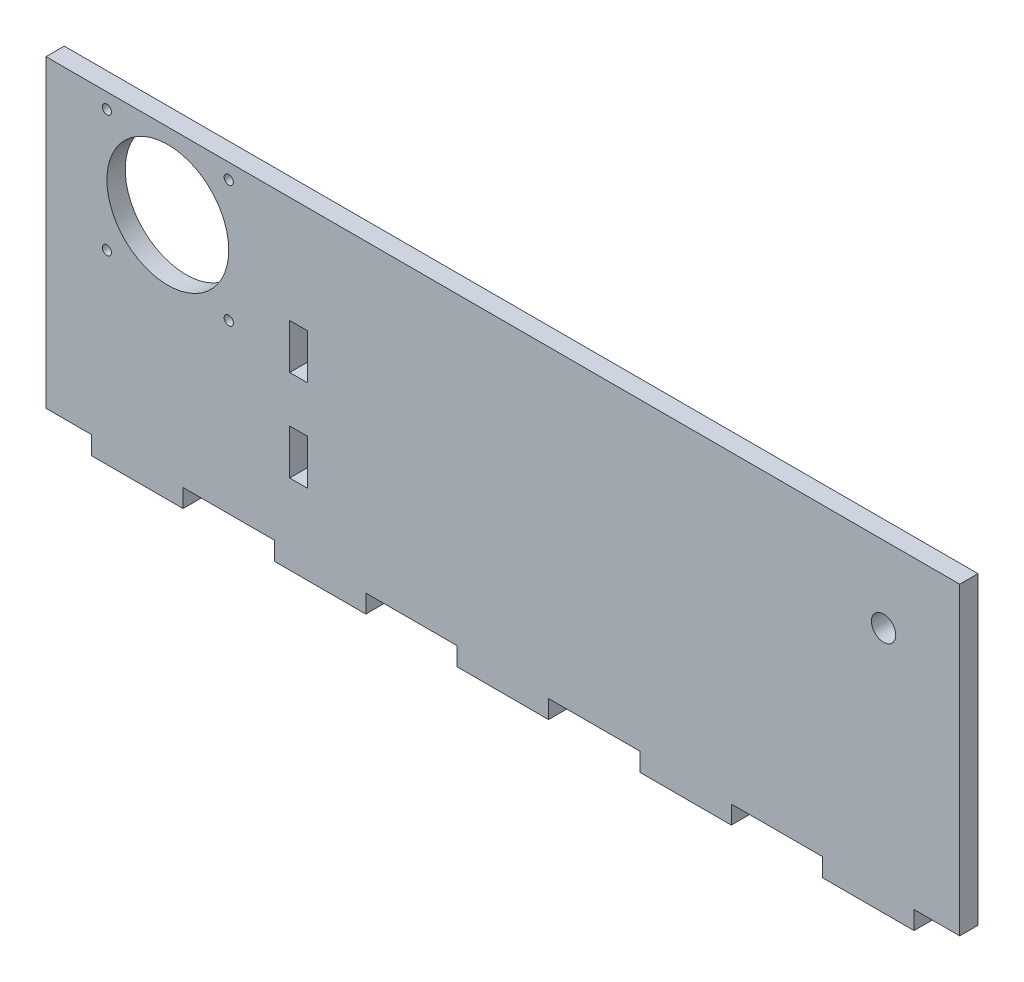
ISO-10303-21;
HEADER;
FILE_DESCRIPTION(('STEP AP214'),'2;1');
FILE_NAME('part.step','',(''),(''),'','','');
FILE_SCHEMA(('AUTOMOTIVE_DESIGN { 1 0 10303 214 1 1 1 1 }'));
ENDSEC;
DATA;
#1=APPLICATION_CONTEXT('core data for automotive mechanical design processes');
#2=APPLICATION_PROTOCOL_DEFINITION('international standard','automotive_design',2000,#1);
#3=PRODUCT_CONTEXT('',#1,'mechanical');
#4=PRODUCT('Part','Part','',(#3));
#5=PRODUCT_RELATED_PRODUCT_CATEGORY('part','',(#4));
#6=PRODUCT_DEFINITION_FORMATION('','',#4);
#7=PRODUCT_DEFINITION_CONTEXT('part definition',#1,'design');
#8=PRODUCT_DEFINITION('design','',#6,#7);
#9=PRODUCT_DEFINITION_SHAPE('','',#8);
#10=(LENGTH_UNIT() NAMED_UNIT(*) SI_UNIT(.MILLI.,.METRE.));
#11=(NAMED_UNIT(*) PLANE_ANGLE_UNIT() SI_UNIT($,.RADIAN.));
#12=(NAMED_UNIT(*) SI_UNIT($,.STERADIAN.) SOLID_ANGLE_UNIT());
#13=UNCERTAINTY_MEASURE_WITH_UNIT(LENGTH_MEASURE(1.E-05),#10,'distance_accuracy_value','');
#14=(GEOMETRIC_REPRESENTATION_CONTEXT(3) GLOBAL_UNCERTAINTY_ASSIGNED_CONTEXT((#13)) GLOBAL_UNIT_ASSIGNED_CONTEXT((#10,
#11,#12)) REPRESENTATION_CONTEXT('',''));
#15=CARTESIAN_POINT('',(0.,0.,0.));
#16=DIRECTION('',(0.,0.,1.));
#17=DIRECTION('',(1.,0.,0.));
#18=AXIS2_PLACEMENT_3D('',#15,#16,#17);
#19=CARTESIAN_POINT('',(150.,-50.,6.));
#20=DIRECTION('',(-1.,0.,0.));
#21=DIRECTION('',(0.,0.,1.));
#22=AXIS2_PLACEMENT_3D('',#19,#20,#21);
#23=PLANE('',#22);
#24=DIRECTION('',(0.,1.,0.));
#25=VECTOR('',#24,1.);
#26=CARTESIAN_POINT('',(150.,-50.,0.));
#27=LINE('',#26,#25);
#28=CARTESIAN_POINT('',(150.,-50.,0.));
#29=VERTEX_POINT('',#28);
#30=CARTESIAN_POINT('',(150.,50.,0.));
#31=VERTEX_POINT('',#30);
#32=EDGE_CURVE('E321',#29,#31,#27,.T.);
#33=ORIENTED_EDGE('',*,*,#32,.T.);
#34=DIRECTION('',(0.,0.,-1.));
#35=VECTOR('',#34,1.);
#36=CARTESIAN_POINT('',(150.,50.,6.));
#37=LINE('',#36,#35);
#38=CARTESIAN_POINT('',(150.,50.,6.));
#39=VERTEX_POINT('',#38);
#40=EDGE_CURVE('E11',#39,#31,#37,.T.);
#41=ORIENTED_EDGE('',*,*,#40,.F.);
#42=DIRECTION('',(0.,1.,0.));
#43=VECTOR('',#42,1.);
#44=CARTESIAN_POINT('',(150.,-50.,6.));
#45=LINE('',#44,#43);
#46=CARTESIAN_POINT('',(150.,-50.,6.));
#47=VERTEX_POINT('',#46);
#48=EDGE_CURVE('E324',#47,#39,#45,.T.);
#49=ORIENTED_EDGE('',*,*,#48,.F.);
#50=DIRECTION('',(0.,0.,-1.));
#51=VECTOR('',#50,1.);
#52=CARTESIAN_POINT('',(150.,-50.,6.));
#53=LINE('',#52,#51);
#54=EDGE_CURVE('E374',#47,#29,#53,.T.);
#55=ORIENTED_EDGE('',*,*,#54,.T.);
#56=EDGE_LOOP('',(#33,#41,#49,#55));
#57=FACE_BOUND('',#56,.T.);
#58=ADVANCED_FACE('F33',(#57),#23,.F.);
#59=CARTESIAN_POINT('',(-150.,50.,6.));
#60=DIRECTION('',(0.,-1.,0.));
#61=DIRECTION('',(0.,0.,-1.));
#62=AXIS2_PLACEMENT_3D('',#59,#60,#61);
#63=PLANE('',#62);
#64=DIRECTION('',(-1.,0.,0.));
#65=VECTOR('',#64,1.);
#66=CARTESIAN_POINT('',(-150.,50.,0.));
#67=LINE('',#66,#65);
#68=CARTESIAN_POINT('',(-150.,50.,0.));
#69=VERTEX_POINT('',#68);
#70=EDGE_CURVE('E377',#31,#69,#67,.T.);
#71=ORIENTED_EDGE('',*,*,#70,.T.);
#72=DIRECTION('',(0.,0.,-1.));
#73=VECTOR('',#72,1.);
#74=CARTESIAN_POINT('',(-150.,50.,6.));
#75=LINE('',#74,#73);
#76=CARTESIAN_POINT('',(-150.,50.,6.));
#77=VERTEX_POINT('',#76);
#78=EDGE_CURVE('E40',#77,#69,#75,.T.);
#79=ORIENTED_EDGE('',*,*,#78,.F.);
#80=DIRECTION('',(-1.,0.,0.));
#81=VECTOR('',#80,1.);
#82=CARTESIAN_POINT('',(-150.,50.,6.));
#83=LINE('',#82,#81);
#84=EDGE_CURVE('E327',#39,#77,#83,.T.);
#85=ORIENTED_EDGE('',*,*,#84,.F.);
#86=ORIENTED_EDGE('',*,*,#40,.T.);
#87=EDGE_LOOP('',(#71,#79,#85,#86));
#88=FACE_BOUND('',#87,.T.);
#89=ADVANCED_FACE('F513',(#88),#63,.F.);
#90=CARTESIAN_POINT('',(-150.,-50.,6.));
#91=DIRECTION('',(1.,0.,0.));
#92=DIRECTION('',(0.,0.,-1.));
#93=AXIS2_PLACEMENT_3D('',#90,#91,#92);
#94=PLANE('',#93);
#95=DIRECTION('',(0.,-1.,0.));
#96=VECTOR('',#95,1.);
#97=CARTESIAN_POINT('',(-150.,-50.,0.));
#98=LINE('',#97,#96);
#99=CARTESIAN_POINT('',(-150.,-50.,0.));
#100=VERTEX_POINT('',#99);
#101=EDGE_CURVE('E379',#69,#100,#98,.T.);
#102=ORIENTED_EDGE('',*,*,#101,.T.);
#103=DIRECTION('',(0.,0.,-1.));
#104=VECTOR('',#103,1.);
#105=CARTESIAN_POINT('',(-150.,-50.,6.));
#106=LINE('',#105,#104);
#107=CARTESIAN_POINT('',(-150.,-50.,6.));
#108=VERTEX_POINT('',#107);
#109=EDGE_CURVE('E484',#108,#100,#106,.T.);
#110=ORIENTED_EDGE('',*,*,#109,.F.);
#111=DIRECTION('',(0.,-1.,0.));
#112=VECTOR('',#111,1.);
#113=CARTESIAN_POINT('',(-150.,-50.,6.));
#114=LINE('',#113,#112);
#115=EDGE_CURVE('E330',#77,#108,#114,.T.);
#116=ORIENTED_EDGE('',*,*,#115,.F.);
#117=ORIENTED_EDGE('',*,*,#78,.T.);
#118=EDGE_LOOP('',(#102,#110,#116,#117));
#119=FACE_BOUND('',#118,.T.);
#120=ADVANCED_FACE('F491',(#119),#94,.F.);
#121=CARTESIAN_POINT('',(-150.,-50.,6.));
#122=DIRECTION('',(0.,1.,0.));
#123=DIRECTION('',(0.,0.,1.));
#124=AXIS2_PLACEMENT_3D('',#121,#122,#123);
#125=PLANE('',#124);
#126=DIRECTION('',(1.,0.,0.));
#127=VECTOR('',#126,1.);
#128=CARTESIAN_POINT('',(-150.,-50.,0.));
#129=LINE('',#128,#127);
#130=CARTESIAN_POINT('',(-135.,-50.,0.));
#131=VERTEX_POINT('',#130);
#132=EDGE_CURVE('E381',#100,#131,#129,.T.);
#133=ORIENTED_EDGE('',*,*,#132,.T.);
#134=DIRECTION('',(0.,0.,-1.));
#135=VECTOR('',#134,1.);
#136=CARTESIAN_POINT('',(-135.,-50.,6.));
#137=LINE('',#136,#135);
#138=CARTESIAN_POINT('',(-135.,-50.,6.));
#139=VERTEX_POINT('',#138);
#140=EDGE_CURVE('E481',#139,#131,#137,.T.);
#141=ORIENTED_EDGE('',*,*,#140,.F.);
#142=DIRECTION('',(1.,0.,0.));
#143=VECTOR('',#142,1.);
#144=CARTESIAN_POINT('',(-150.,-50.,6.));
#145=LINE('',#144,#143);
#146=EDGE_CURVE('E332',#108,#139,#145,.T.);
#147=ORIENTED_EDGE('',*,*,#146,.F.);
#148=ORIENTED_EDGE('',*,*,#109,.T.);
#149=EDGE_LOOP('',(#133,#141,#147,#148));
#150=FACE_BOUND('',#149,.T.);
#151=ADVANCED_FACE('F501',(#150),#125,.F.);
#152=CARTESIAN_POINT('',(-135.,-50.,6.));
#153=DIRECTION('',(1.,0.,0.));
#154=DIRECTION('',(0.,0.,-1.));
#155=AXIS2_PLACEMENT_3D('',#152,#153,#154);
#156=PLANE('',#155);
#157=DIRECTION('',(0.,-1.,0.));
#158=VECTOR('',#157,1.);
#159=CARTESIAN_POINT('',(-135.,-50.,0.));
#160=LINE('',#159,#158);
#161=CARTESIAN_POINT('',(-135.,-56.,0.));
#162=VERTEX_POINT('',#161);
#163=EDGE_CURVE('E383',#131,#162,#160,.T.);
#164=ORIENTED_EDGE('',*,*,#163,.T.);
#165=DIRECTION('',(0.,0.,-1.));
#166=VECTOR('',#165,1.);
#167=CARTESIAN_POINT('',(-135.,-56.,6.));
#168=LINE('',#167,#166);
#169=CARTESIAN_POINT('',(-135.,-56.,6.));
#170=VERTEX_POINT('',#169);
#171=EDGE_CURVE('E478',#170,#162,#168,.T.);
#172=ORIENTED_EDGE('',*,*,#171,.F.);
#173=DIRECTION('',(0.,-1.,0.));
#174=VECTOR('',#173,1.);
#175=CARTESIAN_POINT('',(-135.,-50.,6.));
#176=LINE('',#175,#174);
#177=EDGE_CURVE('E334',#139,#170,#176,.T.);
#178=ORIENTED_EDGE('',*,*,#177,.F.);
#179=ORIENTED_EDGE('',*,*,#140,.T.);
#180=EDGE_LOOP('',(#164,#172,#178,#179));
#181=FACE_BOUND('',#180,.T.);
#182=ADVANCED_FACE('F505',(#181),#156,.F.);
#183=CARTESIAN_POINT('',(-135.,-56.,6.));
#184=DIRECTION('',(0.,1.,0.));
#185=DIRECTION('',(-1.,0.,0.));
#186=AXIS2_PLACEMENT_3D('',#183,#184,#185);
#187=PLANE('',#186);
#188=DIRECTION('',(1.,0.,0.));
#189=VECTOR('',#188,1.);
#190=CARTESIAN_POINT('',(-135.,-56.,0.));
#191=LINE('',#190,#189);
#192=CARTESIAN_POINT('',(-105.,-56.,0.));
#193=VERTEX_POINT('',#192);
#194=EDGE_CURVE('E385',#162,#193,#191,.T.);
#195=ORIENTED_EDGE('',*,*,#194,.T.);
#196=DIRECTION('',(0.,0.,-1.));
#197=VECTOR('',#196,1.);
#198=CARTESIAN_POINT('',(-105.,-56.,6.));
#199=LINE('',#198,#197);
#200=CARTESIAN_POINT('',(-105.,-56.,6.));
#201=VERTEX_POINT('',#200);
#202=EDGE_CURVE('E475',#201,#193,#199,.T.);
#203=ORIENTED_EDGE('',*,*,#202,.F.);
#204=DIRECTION('',(1.,0.,0.));
#205=VECTOR('',#204,1.);
#206=CARTESIAN_POINT('',(-135.,-56.,6.));
#207=LINE('',#206,#205);
#208=EDGE_CURVE('E336',#170,#201,#207,.T.);
#209=ORIENTED_EDGE('',*,*,#208,.F.);
#210=ORIENTED_EDGE('',*,*,#171,.T.);
#211=EDGE_LOOP('',(#195,#203,#209,#210));
#212=FACE_BOUND('',#211,.T.);
#213=ADVANCED_FACE('F606',(#212),#187,.F.);
#214=CARTESIAN_POINT('',(-105.,-50.,6.));
#215=DIRECTION('',(-1.,0.,0.));
#216=DIRECTION('',(0.,0.,1.));
#217=AXIS2_PLACEMENT_3D('',#214,#215,#216);
#218=PLANE('',#217);
#219=DIRECTION('',(0.,1.,0.));
#220=VECTOR('',#219,1.);
#221=CARTESIAN_POINT('',(-105.,-50.,0.));
#222=LINE('',#221,#220);
#223=CARTESIAN_POINT('',(-105.,-50.,0.));
#224=VERTEX_POINT('',#223);
#225=EDGE_CURVE('E387',#193,#224,#222,.T.);
#226=ORIENTED_EDGE('',*,*,#225,.T.);
#227=DIRECTION('',(0.,0.,-1.));
#228=VECTOR('',#227,1.);
#229=CARTESIAN_POINT('',(-105.,-50.,6.));
#230=LINE('',#229,#228);
#231=CARTESIAN_POINT('',(-105.,-50.,6.));
#232=VERTEX_POINT('',#231);
#233=EDGE_CURVE('E472',#232,#224,#230,.T.);
#234=ORIENTED_EDGE('',*,*,#233,.F.);
#235=DIRECTION('',(0.,1.,0.));
#236=VECTOR('',#235,1.);
#237=CARTESIAN_POINT('',(-105.,-50.,6.));
#238=LINE('',#237,#236);
#239=EDGE_CURVE('E338',#201,#232,#238,.T.);
#240=ORIENTED_EDGE('',*,*,#239,.F.);
#241=ORIENTED_EDGE('',*,*,#202,.T.);
#242=EDGE_LOOP('',(#226,#234,#240,#241));
#243=FACE_BOUND('',#242,.T.);
#244=ADVANCED_FACE('F604',(#243),#218,.F.);
#245=CARTESIAN_POINT('',(-105.,-50.,6.));
#246=DIRECTION('',(0.,1.,0.));
#247=DIRECTION('',(-1.,0.,0.));
#248=AXIS2_PLACEMENT_3D('',#245,#246,#247);
#249=PLANE('',#248);
#250=DIRECTION('',(1.,0.,0.));
#251=VECTOR('',#250,1.);
#252=CARTESIAN_POINT('',(-105.,-50.,0.));
#253=LINE('',#252,#251);
#254=CARTESIAN_POINT('',(-75.,-50.,0.));
#255=VERTEX_POINT('',#254);
#256=EDGE_CURVE('E389',#224,#255,#253,.T.);
#257=ORIENTED_EDGE('',*,*,#256,.T.);
#258=DIRECTION('',(0.,0.,-1.));
#259=VECTOR('',#258,1.);
#260=CARTESIAN_POINT('',(-75.,-50.,6.));
#261=LINE('',#260,#259);
#262=CARTESIAN_POINT('',(-75.,-50.,6.));
#263=VERTEX_POINT('',#262);
#264=EDGE_CURVE('E469',#263,#255,#261,.T.);
#265=ORIENTED_EDGE('',*,*,#264,.F.);
#266=DIRECTION('',(1.,0.,0.));
#267=VECTOR('',#266,1.);
#268=CARTESIAN_POINT('',(-105.,-50.,6.));
#269=LINE('',#268,#267);
#270=EDGE_CURVE('E340',#232,#263,#269,.T.);
#271=ORIENTED_EDGE('',*,*,#270,.F.);
#272=ORIENTED_EDGE('',*,*,#233,.T.);
#273=EDGE_LOOP('',(#257,#265,#271,#272));
#274=FACE_BOUND('',#273,.T.);
#275=ADVANCED_FACE('F600',(#274),#249,.F.);
#276=CARTESIAN_POINT('',(-75.,-50.,6.));
#277=DIRECTION('',(1.,0.,0.));
#278=DIRECTION('',(0.,0.,-1.));
#279=AXIS2_PLACEMENT_3D('',#276,#277,#278);
#280=PLANE('',#279);
#281=DIRECTION('',(0.,-1.,0.));
#282=VECTOR('',#281,1.);
#283=CARTESIAN_POINT('',(-75.,-50.,0.));
#284=LINE('',#283,#282);
#285=CARTESIAN_POINT('',(-75.,-56.,0.));
#286=VERTEX_POINT('',#285);
#287=EDGE_CURVE('E391',#255,#286,#284,.T.);
#288=ORIENTED_EDGE('',*,*,#287,.T.);
#289=DIRECTION('',(0.,0.,-1.));
#290=VECTOR('',#289,1.);
#291=CARTESIAN_POINT('',(-75.,-56.,6.));
#292=LINE('',#291,#290);
#293=CARTESIAN_POINT('',(-75.,-56.,6.));
#294=VERTEX_POINT('',#293);
#295=EDGE_CURVE('E466',#294,#286,#292,.T.);
#296=ORIENTED_EDGE('',*,*,#295,.F.);
#297=DIRECTION('',(0.,-1.,0.));
#298=VECTOR('',#297,1.);
#299=CARTESIAN_POINT('',(-75.,-50.,6.));
#300=LINE('',#299,#298);
#301=EDGE_CURVE('E342',#263,#294,#300,.T.);
#302=ORIENTED_EDGE('',*,*,#301,.F.);
#303=ORIENTED_EDGE('',*,*,#264,.T.);
#304=EDGE_LOOP('',(#288,#296,#302,#303));
#305=FACE_BOUND('',#304,.T.);
#306=ADVANCED_FACE('F595',(#305),#280,.F.);
#307=CARTESIAN_POINT('',(-75.,-56.,6.));
#308=DIRECTION('',(0.,1.,0.));
#309=DIRECTION('',(-1.,0.,0.));
#310=AXIS2_PLACEMENT_3D('',#307,#308,#309);
#311=PLANE('',#310);
#312=DIRECTION('',(1.,0.,0.));
#313=VECTOR('',#312,1.);
#314=CARTESIAN_POINT('',(-75.,-56.,0.));
#315=LINE('',#314,#313);
#316=CARTESIAN_POINT('',(-45.,-56.,0.));
#317=VERTEX_POINT('',#316);
#318=EDGE_CURVE('E393',#286,#317,#315,.T.);
#319=ORIENTED_EDGE('',*,*,#318,.T.);
#320=DIRECTION('',(0.,0.,-1.));
#321=VECTOR('',#320,1.);
#322=CARTESIAN_POINT('',(-45.,-56.,6.));
#323=LINE('',#322,#321);
#324=CARTESIAN_POINT('',(-45.,-56.,6.));
#325=VERTEX_POINT('',#324);
#326=EDGE_CURVE('E463',#325,#317,#323,.T.);
#327=ORIENTED_EDGE('',*,*,#326,.F.);
#328=DIRECTION('',(1.,0.,0.));
#329=VECTOR('',#328,1.);
#330=CARTESIAN_POINT('',(-75.,-56.,6.));
#331=LINE('',#330,#329);
#332=EDGE_CURVE('E344',#294,#325,#331,.T.);
#333=ORIENTED_EDGE('',*,*,#332,.F.);
#334=ORIENTED_EDGE('',*,*,#295,.T.);
#335=EDGE_LOOP('',(#319,#327,#333,#334));
#336=FACE_BOUND('',#335,.T.);
#337=ADVANCED_FACE('F589',(#336),#311,.F.);
#338=CARTESIAN_POINT('',(-45.,-50.,6.));
#339=DIRECTION('',(-1.,0.,0.));
#340=DIRECTION('',(0.,0.,1.));
#341=AXIS2_PLACEMENT_3D('',#338,#339,#340);
#342=PLANE('',#341);
#343=DIRECTION('',(0.,1.,0.));
#344=VECTOR('',#343,1.);
#345=CARTESIAN_POINT('',(-45.,-50.,0.));
#346=LINE('',#345,#344);
#347=CARTESIAN_POINT('',(-45.,-50.,0.));
#348=VERTEX_POINT('',#347);
#349=EDGE_CURVE('E395',#317,#348,#346,.T.);
#350=ORIENTED_EDGE('',*,*,#349,.T.);
#351=DIRECTION('',(0.,0.,-1.));
#352=VECTOR('',#351,1.);
#353=CARTESIAN_POINT('',(-45.,-50.,6.));
#354=LINE('',#353,#352);
#355=CARTESIAN_POINT('',(-45.,-50.,6.));
#356=VERTEX_POINT('',#355);
#357=EDGE_CURVE('E460',#356,#348,#354,.T.);
#358=ORIENTED_EDGE('',*,*,#357,.F.);
#359=DIRECTION('',(0.,1.,0.));
#360=VECTOR('',#359,1.);
#361=CARTESIAN_POINT('',(-45.,-50.,6.));
#362=LINE('',#361,#360);
#363=EDGE_CURVE('E346',#325,#356,#362,.T.);
#364=ORIENTED_EDGE('',*,*,#363,.F.);
#365=ORIENTED_EDGE('',*,*,#326,.T.);
#366=EDGE_LOOP('',(#350,#358,#364,#365));
#367=FACE_BOUND('',#366,.T.);
#368=ADVANCED_FACE('F585',(#367),#342,.F.);
#369=CARTESIAN_POINT('',(-45.,-50.,6.));
#370=DIRECTION('',(0.,1.,0.));
#371=DIRECTION('',(-1.,0.,0.));
#372=AXIS2_PLACEMENT_3D('',#369,#370,#371);
#373=PLANE('',#372);
#374=DIRECTION('',(1.,0.,0.));
#375=VECTOR('',#374,1.);
#376=CARTESIAN_POINT('',(-45.,-50.,0.));
#377=LINE('',#376,#375);
#378=CARTESIAN_POINT('',(-15.,-50.,0.));
#379=VERTEX_POINT('',#378);
#380=EDGE_CURVE('E397',#348,#379,#377,.T.);
#381=ORIENTED_EDGE('',*,*,#380,.T.);
#382=DIRECTION('',(0.,0.,-1.));
#383=VECTOR('',#382,1.);
#384=CARTESIAN_POINT('',(-15.,-50.,6.));
#385=LINE('',#384,#383);
#386=CARTESIAN_POINT('',(-15.,-50.,6.));
#387=VERTEX_POINT('',#386);
#388=EDGE_CURVE('E457',#387,#379,#385,.T.);
#389=ORIENTED_EDGE('',*,*,#388,.F.);
#390=DIRECTION('',(1.,0.,0.));
#391=VECTOR('',#390,1.);
#392=CARTESIAN_POINT('',(-45.,-50.,6.));
#393=LINE('',#392,#391);
#394=EDGE_CURVE('E348',#356,#387,#393,.T.);
#395=ORIENTED_EDGE('',*,*,#394,.F.);
#396=ORIENTED_EDGE('',*,*,#357,.T.);
#397=EDGE_LOOP('',(#381,#389,#395,#396));
#398=FACE_BOUND('',#397,.T.);
#399=ADVANCED_FACE('F580',(#398),#373,.F.);
#400=CARTESIAN_POINT('',(-15.,-50.,6.));
#401=DIRECTION('',(1.,0.,0.));
#402=DIRECTION('',(0.,0.,-1.));
#403=AXIS2_PLACEMENT_3D('',#400,#401,#402);
#404=PLANE('',#403);
#405=DIRECTION('',(0.,-1.,0.));
#406=VECTOR('',#405,1.);
#407=CARTESIAN_POINT('',(-15.,-50.,0.));
#408=LINE('',#407,#406);
#409=CARTESIAN_POINT('',(-15.,-56.,0.));
#410=VERTEX_POINT('',#409);
#411=EDGE_CURVE('E399',#379,#410,#408,.T.);
#412=ORIENTED_EDGE('',*,*,#411,.T.);
#413=DIRECTION('',(0.,0.,-1.));
#414=VECTOR('',#413,1.);
#415=CARTESIAN_POINT('',(-15.,-56.,6.));
#416=LINE('',#415,#414);
#417=CARTESIAN_POINT('',(-15.,-56.,6.));
#418=VERTEX_POINT('',#417);
#419=EDGE_CURVE('E454',#418,#410,#416,.T.);
#420=ORIENTED_EDGE('',*,*,#419,.F.);
#421=DIRECTION('',(0.,-1.,0.));
#422=VECTOR('',#421,1.);
#423=CARTESIAN_POINT('',(-15.,-50.,6.));
#424=LINE('',#423,#422);
#425=EDGE_CURVE('E350',#387,#418,#424,.T.);
#426=ORIENTED_EDGE('',*,*,#425,.F.);
#427=ORIENTED_EDGE('',*,*,#388,.T.);
#428=EDGE_LOOP('',(#412,#420,#426,#427));
#429=FACE_BOUND('',#428,.T.);
#430=ADVANCED_FACE('F574',(#429),#404,.F.);
#431=CARTESIAN_POINT('',(-15.,-56.,6.));
#432=DIRECTION('',(0.,1.,0.));
#433=DIRECTION('',(-1.,0.,0.));
#434=AXIS2_PLACEMENT_3D('',#431,#432,#433);
#435=PLANE('',#434);
#436=DIRECTION('',(1.,0.,0.));
#437=VECTOR('',#436,1.);
#438=CARTESIAN_POINT('',(-15.,-56.,0.));
#439=LINE('',#438,#437);
#440=CARTESIAN_POINT('',(15.,-56.,0.));
#441=VERTEX_POINT('',#440);
#442=EDGE_CURVE('E401',#410,#441,#439,.T.);
#443=ORIENTED_EDGE('',*,*,#442,.T.);
#444=DIRECTION('',(0.,0.,-1.));
#445=VECTOR('',#444,1.);
#446=CARTESIAN_POINT('',(15.,-56.,6.));
#447=LINE('',#446,#445);
#448=CARTESIAN_POINT('',(15.,-56.,6.));
#449=VERTEX_POINT('',#448);
#450=EDGE_CURVE('E451',#449,#441,#447,.T.);
#451=ORIENTED_EDGE('',*,*,#450,.F.);
#452=DIRECTION('',(1.,0.,0.));
#453=VECTOR('',#452,1.);
#454=CARTESIAN_POINT('',(-15.,-56.,6.));
#455=LINE('',#454,#453);
#456=EDGE_CURVE('E352',#418,#449,#455,.T.);
#457=ORIENTED_EDGE('',*,*,#456,.F.);
#458=ORIENTED_EDGE('',*,*,#419,.T.);
#459=EDGE_LOOP('',(#443,#451,#457,#458));
#460=FACE_BOUND('',#459,.T.);
#461=ADVANCED_FACE('F570',(#460),#435,.F.);
#462=CARTESIAN_POINT('',(15.,-50.,6.));
#463=DIRECTION('',(-1.,0.,0.));
#464=DIRECTION('',(0.,0.,1.));
#465=AXIS2_PLACEMENT_3D('',#462,#463,#464);
#466=PLANE('',#465);
#467=DIRECTION('',(0.,1.,0.));
#468=VECTOR('',#467,1.);
#469=CARTESIAN_POINT('',(15.,-50.,0.));
#470=LINE('',#469,#468);
#471=CARTESIAN_POINT('',(15.,-50.,0.));
#472=VERTEX_POINT('',#471);
#473=EDGE_CURVE('E403',#441,#472,#470,.T.);
#474=ORIENTED_EDGE('',*,*,#473,.T.);
#475=DIRECTION('',(0.,0.,-1.));
#476=VECTOR('',#475,1.);
#477=CARTESIAN_POINT('',(15.,-50.,6.));
#478=LINE('',#477,#476);
#479=CARTESIAN_POINT('',(15.,-50.,6.));
#480=VERTEX_POINT('',#479);
#481=EDGE_CURVE('E448',#480,#472,#478,.T.);
#482=ORIENTED_EDGE('',*,*,#481,.F.);
#483=DIRECTION('',(0.,1.,0.));
#484=VECTOR('',#483,1.);
#485=CARTESIAN_POINT('',(15.,-50.,6.));
#486=LINE('',#485,#484);
#487=EDGE_CURVE('E354',#449,#480,#486,.T.);
#488=ORIENTED_EDGE('',*,*,#487,.F.);
#489=ORIENTED_EDGE('',*,*,#450,.T.);
#490=EDGE_LOOP('',(#474,#482,#488,#489));
#491=FACE_BOUND('',#490,.T.);
#492=ADVANCED_FACE('F565',(#491),#466,.F.);
#493=CARTESIAN_POINT('',(15.,-50.,6.));
#494=DIRECTION('',(0.,1.,0.));
#495=DIRECTION('',(-1.,0.,0.));
#496=AXIS2_PLACEMENT_3D('',#493,#494,#495);
#497=PLANE('',#496);
#498=DIRECTION('',(1.,0.,0.));
#499=VECTOR('',#498,1.);
#500=CARTESIAN_POINT('',(15.,-50.,0.));
#501=LINE('',#500,#499);
#502=CARTESIAN_POINT('',(45.,-50.,0.));
#503=VERTEX_POINT('',#502);
#504=EDGE_CURVE('E405',#472,#503,#501,.T.);
#505=ORIENTED_EDGE('',*,*,#504,.T.);
#506=DIRECTION('',(0.,0.,-1.));
#507=VECTOR('',#506,1.);
#508=CARTESIAN_POINT('',(45.,-50.,6.));
#509=LINE('',#508,#507);
#510=CARTESIAN_POINT('',(45.,-50.,6.));
#511=VERTEX_POINT('',#510);
#512=EDGE_CURVE('E445',#511,#503,#509,.T.);
#513=ORIENTED_EDGE('',*,*,#512,.F.);
#514=DIRECTION('',(1.,0.,0.));
#515=VECTOR('',#514,1.);
#516=CARTESIAN_POINT('',(15.,-50.,6.));
#517=LINE('',#516,#515);
#518=EDGE_CURVE('E356',#480,#511,#517,.T.);
#519=ORIENTED_EDGE('',*,*,#518,.F.);
#520=ORIENTED_EDGE('',*,*,#481,.T.);
#521=EDGE_LOOP('',(#505,#513,#519,#520));
#522=FACE_BOUND('',#521,.T.);
#523=ADVANCED_FACE('F559',(#522),#497,.F.);
#524=CARTESIAN_POINT('',(45.,-50.,6.));
#525=DIRECTION('',(1.,0.,0.));
#526=DIRECTION('',(0.,0.,-1.));
#527=AXIS2_PLACEMENT_3D('',#524,#525,#526);
#528=PLANE('',#527);
#529=DIRECTION('',(0.,-1.,0.));
#530=VECTOR('',#529,1.);
#531=CARTESIAN_POINT('',(45.,-50.,0.));
#532=LINE('',#531,#530);
#533=CARTESIAN_POINT('',(45.,-56.,0.));
#534=VERTEX_POINT('',#533);
#535=EDGE_CURVE('E407',#503,#534,#532,.T.);
#536=ORIENTED_EDGE('',*,*,#535,.T.);
#537=DIRECTION('',(0.,0.,-1.));
#538=VECTOR('',#537,1.);
#539=CARTESIAN_POINT('',(45.,-56.,6.));
#540=LINE('',#539,#538);
#541=CARTESIAN_POINT('',(45.,-56.,6.));
#542=VERTEX_POINT('',#541);
#543=EDGE_CURVE('E442',#542,#534,#540,.T.);
#544=ORIENTED_EDGE('',*,*,#543,.F.);
#545=DIRECTION('',(0.,-1.,0.));
#546=VECTOR('',#545,1.);
#547=CARTESIAN_POINT('',(45.,-50.,6.));
#548=LINE('',#547,#546);
#549=EDGE_CURVE('E358',#511,#542,#548,.T.);
#550=ORIENTED_EDGE('',*,*,#549,.F.);
#551=ORIENTED_EDGE('',*,*,#512,.T.);
#552=EDGE_LOOP('',(#536,#544,#550,#551));
#553=FACE_BOUND('',#552,.T.);
#554=ADVANCED_FACE('F555',(#553),#528,.F.);
#555=CARTESIAN_POINT('',(45.,-56.,6.));
#556=DIRECTION('',(0.,1.,0.));
#557=DIRECTION('',(-1.,0.,0.));
#558=AXIS2_PLACEMENT_3D('',#555,#556,#557);
#559=PLANE('',#558);
#560=DIRECTION('',(1.,0.,0.));
#561=VECTOR('',#560,1.);
#562=CARTESIAN_POINT('',(45.,-56.,0.));
#563=LINE('',#562,#561);
#564=CARTESIAN_POINT('',(75.,-56.,0.));
#565=VERTEX_POINT('',#564);
#566=EDGE_CURVE('E409',#534,#565,#563,.T.);
#567=ORIENTED_EDGE('',*,*,#566,.T.);
#568=DIRECTION('',(0.,0.,-1.));
#569=VECTOR('',#568,1.);
#570=CARTESIAN_POINT('',(75.,-56.,6.));
#571=LINE('',#570,#569);
#572=CARTESIAN_POINT('',(75.,-56.,6.));
#573=VERTEX_POINT('',#572);
#574=EDGE_CURVE('E439',#573,#565,#571,.T.);
#575=ORIENTED_EDGE('',*,*,#574,.F.);
#576=DIRECTION('',(1.,0.,0.));
#577=VECTOR('',#576,1.);
#578=CARTESIAN_POINT('',(45.,-56.,6.));
#579=LINE('',#578,#577);
#580=EDGE_CURVE('E360',#542,#573,#579,.T.);
#581=ORIENTED_EDGE('',*,*,#580,.F.);
#582=ORIENTED_EDGE('',*,*,#543,.T.);
#583=EDGE_LOOP('',(#567,#575,#581,#582));
#584=FACE_BOUND('',#583,.T.);
#585=ADVANCED_FACE('F550',(#584),#559,.F.);
#586=CARTESIAN_POINT('',(75.,-50.,6.));
#587=DIRECTION('',(-1.,0.,0.));
#588=DIRECTION('',(0.,0.,1.));
#589=AXIS2_PLACEMENT_3D('',#586,#587,#588);
#590=PLANE('',#589);
#591=DIRECTION('',(0.,1.,0.));
#592=VECTOR('',#591,1.);
#593=CARTESIAN_POINT('',(75.,-50.,0.));
#594=LINE('',#593,#592);
#595=CARTESIAN_POINT('',(75.,-50.,0.));
#596=VERTEX_POINT('',#595);
#597=EDGE_CURVE('E411',#565,#596,#594,.T.);
#598=ORIENTED_EDGE('',*,*,#597,.T.);
#599=DIRECTION('',(0.,0.,-1.));
#600=VECTOR('',#599,1.);
#601=CARTESIAN_POINT('',(75.,-50.,6.));
#602=LINE('',#601,#600);
#603=CARTESIAN_POINT('',(75.,-50.,6.));
#604=VERTEX_POINT('',#603);
#605=EDGE_CURVE('E436',#604,#596,#602,.T.);
#606=ORIENTED_EDGE('',*,*,#605,.F.);
#607=DIRECTION('',(0.,1.,0.));
#608=VECTOR('',#607,1.);
#609=CARTESIAN_POINT('',(75.,-50.,6.));
#610=LINE('',#609,#608);
#611=EDGE_CURVE('E362',#573,#604,#610,.T.);
#612=ORIENTED_EDGE('',*,*,#611,.F.);
#613=ORIENTED_EDGE('',*,*,#574,.T.);
#614=EDGE_LOOP('',(#598,#606,#612,#613));
#615=FACE_BOUND('',#614,.T.);
#616=ADVANCED_FACE('F544',(#615),#590,.F.);
#617=CARTESIAN_POINT('',(75.,-50.,6.));
#618=DIRECTION('',(0.,1.,0.));
#619=DIRECTION('',(-1.,0.,0.));
#620=AXIS2_PLACEMENT_3D('',#617,#618,#619);
#621=PLANE('',#620);
#622=DIRECTION('',(1.,0.,0.));
#623=VECTOR('',#622,1.);
#624=CARTESIAN_POINT('',(75.,-50.,0.));
#625=LINE('',#624,#623);
#626=CARTESIAN_POINT('',(105.,-50.,0.));
#627=VERTEX_POINT('',#626);
#628=EDGE_CURVE('E413',#596,#627,#625,.T.);
#629=ORIENTED_EDGE('',*,*,#628,.T.);
#630=DIRECTION('',(0.,0.,-1.));
#631=VECTOR('',#630,1.);
#632=CARTESIAN_POINT('',(105.,-50.,6.));
#633=LINE('',#632,#631);
#634=CARTESIAN_POINT('',(105.,-50.,6.));
#635=VERTEX_POINT('',#634);
#636=EDGE_CURVE('E433',#635,#627,#633,.T.);
#637=ORIENTED_EDGE('',*,*,#636,.F.);
#638=DIRECTION('',(1.,0.,0.));
#639=VECTOR('',#638,1.);
#640=CARTESIAN_POINT('',(75.,-50.,6.));
#641=LINE('',#640,#639);
#642=EDGE_CURVE('E364',#604,#635,#641,.T.);
#643=ORIENTED_EDGE('',*,*,#642,.F.);
#644=ORIENTED_EDGE('',*,*,#605,.T.);
#645=EDGE_LOOP('',(#629,#637,#643,#644));
#646=FACE_BOUND('',#645,.T.);
#647=ADVANCED_FACE('F540',(#646),#621,.F.);
#648=CARTESIAN_POINT('',(105.,-50.,6.));
#649=DIRECTION('',(1.,0.,0.));
#650=DIRECTION('',(0.,0.,-1.));
#651=AXIS2_PLACEMENT_3D('',#648,#649,#650);
#652=PLANE('',#651);
#653=DIRECTION('',(0.,-1.,0.));
#654=VECTOR('',#653,1.);
#655=CARTESIAN_POINT('',(105.,-50.,0.));
#656=LINE('',#655,#654);
#657=CARTESIAN_POINT('',(105.,-56.,0.));
#658=VERTEX_POINT('',#657);
#659=EDGE_CURVE('E415',#627,#658,#656,.T.);
#660=ORIENTED_EDGE('',*,*,#659,.T.);
#661=DIRECTION('',(0.,0.,-1.));
#662=VECTOR('',#661,1.);
#663=CARTESIAN_POINT('',(105.,-56.,6.));
#664=LINE('',#663,#662);
#665=CARTESIAN_POINT('',(105.,-56.,6.));
#666=VERTEX_POINT('',#665);
#667=EDGE_CURVE('E430',#666,#658,#664,.T.);
#668=ORIENTED_EDGE('',*,*,#667,.F.);
#669=DIRECTION('',(0.,-1.,0.));
#670=VECTOR('',#669,1.);
#671=CARTESIAN_POINT('',(105.,-50.,6.));
#672=LINE('',#671,#670);
#673=EDGE_CURVE('E366',#635,#666,#672,.T.);
#674=ORIENTED_EDGE('',*,*,#673,.F.);
#675=ORIENTED_EDGE('',*,*,#636,.T.);
#676=EDGE_LOOP('',(#660,#668,#674,#675));
#677=FACE_BOUND('',#676,.T.);
#678=ADVANCED_FACE('F535',(#677),#652,.F.);
#679=CARTESIAN_POINT('',(105.,-56.,6.));
#680=DIRECTION('',(0.,1.,0.));
#681=DIRECTION('',(-1.,0.,0.));
#682=AXIS2_PLACEMENT_3D('',#679,#680,#681);
#683=PLANE('',#682);
#684=DIRECTION('',(1.,0.,0.));
#685=VECTOR('',#684,1.);
#686=CARTESIAN_POINT('',(105.,-56.,0.));
#687=LINE('',#686,#685);
#688=CARTESIAN_POINT('',(135.,-56.,0.));
#689=VERTEX_POINT('',#688);
#690=EDGE_CURVE('E417',#658,#689,#687,.T.);
#691=ORIENTED_EDGE('',*,*,#690,.T.);
#692=DIRECTION('',(0.,0.,-1.));
#693=VECTOR('',#692,1.);
#694=CARTESIAN_POINT('',(135.,-56.,6.));
#695=LINE('',#694,#693);
#696=CARTESIAN_POINT('',(135.,-56.,6.));
#697=VERTEX_POINT('',#696);
#698=EDGE_CURVE('E427',#697,#689,#695,.T.);
#699=ORIENTED_EDGE('',*,*,#698,.F.);
#700=DIRECTION('',(1.,0.,0.));
#701=VECTOR('',#700,1.);
#702=CARTESIAN_POINT('',(105.,-56.,6.));
#703=LINE('',#702,#701);
#704=EDGE_CURVE('E368',#666,#697,#703,.T.);
#705=ORIENTED_EDGE('',*,*,#704,.F.);
#706=ORIENTED_EDGE('',*,*,#667,.T.);
#707=EDGE_LOOP('',(#691,#699,#705,#706));
#708=FACE_BOUND('',#707,.T.);
#709=ADVANCED_FACE('F529',(#708),#683,.F.);
#710=CARTESIAN_POINT('',(135.,-50.,6.));
#711=DIRECTION('',(-1.,0.,0.));
#712=DIRECTION('',(0.,0.,1.));
#713=AXIS2_PLACEMENT_3D('',#710,#711,#712);
#714=PLANE('',#713);
#715=DIRECTION('',(0.,1.,0.));
#716=VECTOR('',#715,1.);
#717=CARTESIAN_POINT('',(135.,-50.,0.));
#718=LINE('',#717,#716);
#719=CARTESIAN_POINT('',(135.,-50.,0.));
#720=VERTEX_POINT('',#719);
#721=EDGE_CURVE('E419',#689,#720,#718,.T.);
#722=ORIENTED_EDGE('',*,*,#721,.T.);
#723=DIRECTION('',(0.,0.,-1.));
#724=VECTOR('',#723,1.);
#725=CARTESIAN_POINT('',(135.,-50.,6.));
#726=LINE('',#725,#724);
#727=CARTESIAN_POINT('',(135.,-50.,6.));
#728=VERTEX_POINT('',#727);
#729=EDGE_CURVE('E424',#728,#720,#726,.T.);
#730=ORIENTED_EDGE('',*,*,#729,.F.);
#731=DIRECTION('',(0.,1.,0.));
#732=VECTOR('',#731,1.);
#733=CARTESIAN_POINT('',(135.,-50.,6.));
#734=LINE('',#733,#732);
#735=EDGE_CURVE('E370',#697,#728,#734,.T.);
#736=ORIENTED_EDGE('',*,*,#735,.F.);
#737=ORIENTED_EDGE('',*,*,#698,.T.);
#738=EDGE_LOOP('',(#722,#730,#736,#737));
#739=FACE_BOUND('',#738,.T.);
#740=ADVANCED_FACE('F525',(#739),#714,.F.);
#741=CARTESIAN_POINT('',(135.,-50.,6.));
#742=DIRECTION('',(0.,1.,0.));
#743=DIRECTION('',(-1.,0.,0.));
#744=AXIS2_PLACEMENT_3D('',#741,#742,#743);
#745=PLANE('',#744);
#746=DIRECTION('',(1.,0.,0.));
#747=VECTOR('',#746,1.);
#748=CARTESIAN_POINT('',(135.,-50.,0.));
#749=LINE('',#748,#747);
#750=EDGE_CURVE('E328',#720,#29,#749,.T.);
#751=ORIENTED_EDGE('',*,*,#750,.T.);
#752=ORIENTED_EDGE('',*,*,#54,.F.);
#753=DIRECTION('',(1.,0.,0.));
#754=VECTOR('',#753,1.);
#755=CARTESIAN_POINT('',(135.,-50.,6.));
#756=LINE('',#755,#754);
#757=EDGE_CURVE('E372',#728,#47,#756,.T.);
#758=ORIENTED_EDGE('',*,*,#757,.F.);
#759=ORIENTED_EDGE('',*,*,#729,.T.);
#760=EDGE_LOOP('',(#751,#752,#758,#759));
#761=FACE_BOUND('',#760,.T.);
#762=ADVANCED_FACE('F520',(#761),#745,.F.);
#763=CARTESIAN_POINT('',(0.,0.,6.));
#764=DIRECTION('',(0.,0.,-1.));
#765=DIRECTION('',(-1.,0.,0.));
#766=AXIS2_PLACEMENT_3D('',#763,#764,#765);
#767=PLANE('',#766);
#768=CARTESIAN_POINT('',(-90.,45.,6.));
#769=DIRECTION('',(0.,0.,1.));
#770=DIRECTION('',(1.,0.,0.));
#771=AXIS2_PLACEMENT_3D('',#768,#769,#770);
#772=CIRCLE('',#771,1.5);
#773=CARTESIAN_POINT('',(-88.5,45.,6.));
#774=VERTEX_POINT('',#773);
#775=EDGE_CURVE('E287',#774,#774,#772,.T.);
#776=ORIENTED_EDGE('',*,*,#775,.F.);
#777=EDGE_LOOP('',(#776));
#778=FACE_BOUND('',#777,.T.);
#779=CARTESIAN_POINT('',(-90.,5.,6.));
#780=DIRECTION('',(0.,0.,1.));
#781=DIRECTION('',(1.,0.,0.));
#782=AXIS2_PLACEMENT_3D('',#779,#780,#781);
#783=CIRCLE('',#782,1.5);
#784=CARTESIAN_POINT('',(-88.5,5.,6.));
#785=VERTEX_POINT('',#784);
#786=EDGE_CURVE('E943',#785,#785,#783,.T.);
#787=ORIENTED_EDGE('',*,*,#786,.F.);
#788=EDGE_LOOP('',(#787));
#789=FACE_BOUND('',#788,.T.);
#790=CARTESIAN_POINT('',(-130.,5.,6.));
#791=DIRECTION('',(0.,0.,1.));
#792=DIRECTION('',(1.,0.,0.));
#793=AXIS2_PLACEMENT_3D('',#790,#791,#792);
#794=CIRCLE('',#793,1.5);
#795=CARTESIAN_POINT('',(-128.5,5.,6.));
#796=VERTEX_POINT('',#795);
#797=EDGE_CURVE('E953',#796,#796,#794,.T.);
#798=ORIENTED_EDGE('',*,*,#797,.F.);
#799=EDGE_LOOP('',(#798));
#800=FACE_BOUND('',#799,.T.);
#801=CARTESIAN_POINT('',(125.,25.,6.));
#802=DIRECTION('',(0.,0.,1.));
#803=DIRECTION('',(1.,0.,0.));
#804=AXIS2_PLACEMENT_3D('',#801,#802,#803);
#805=CIRCLE('',#804,3.99999999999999);
#806=CARTESIAN_POINT('',(129.,25.,6.));
#807=VERTEX_POINT('',#806);
#808=EDGE_CURVE('E972',#807,#807,#805,.T.);
#809=ORIENTED_EDGE('',*,*,#808,.F.);
#810=EDGE_LOOP('',(#809));
#811=FACE_BOUND('',#810,.T.);
#812=DIRECTION('',(1.,0.,0.));
#813=VECTOR('',#812,1.);
#814=CARTESIAN_POINT('',(-70.,0.200000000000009,6.));
#815=LINE('',#814,#813);
#816=CARTESIAN_POINT('',(-70.,0.200000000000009,6.));
#817=VERTEX_POINT('',#816);
#818=CARTESIAN_POINT('',(-64.2,0.200000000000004,6.));
#819=VERTEX_POINT('',#818);
#820=EDGE_CURVE('E297',#817,#819,#815,.T.);
#821=ORIENTED_EDGE('',*,*,#820,.F.);
#822=DIRECTION('',(0.,-1.,0.));
#823=VECTOR('',#822,1.);
#824=CARTESIAN_POINT('',(-70.,15.,6.));
#825=LINE('',#824,#823);
#826=CARTESIAN_POINT('',(-70.,15.,6.));
#827=VERTEX_POINT('',#826);
#828=EDGE_CURVE('E47',#827,#817,#825,.T.);
#829=ORIENTED_EDGE('',*,*,#828,.F.);
#830=DIRECTION('',(-1.,0.,0.));
#831=VECTOR('',#830,1.);
#832=CARTESIAN_POINT('',(-70.,15.,6.));
#833=LINE('',#832,#831);
#834=CARTESIAN_POINT('',(-64.2,15.,6.));
#835=VERTEX_POINT('',#834);
#836=EDGE_CURVE('E303',#835,#827,#833,.T.);
#837=ORIENTED_EDGE('',*,*,#836,.F.);
#838=DIRECTION('',(0.,1.,0.));
#839=VECTOR('',#838,1.);
#840=CARTESIAN_POINT('',(-64.2,15.,6.));
#841=LINE('',#840,#839);
#842=EDGE_CURVE('E300',#819,#835,#841,.T.);
#843=ORIENTED_EDGE('',*,*,#842,.F.);
#844=EDGE_LOOP('',(#821,#829,#837,#843));
#845=FACE_BOUND('',#844,.T.);
#846=DIRECTION('',(1.,0.,0.));
#847=VECTOR('',#846,1.);
#848=CARTESIAN_POINT('',(-70.,-29.8,6.));
#849=LINE('',#848,#847);
#850=CARTESIAN_POINT('',(-70.,-29.8,6.));
#851=VERTEX_POINT('',#850);
#852=CARTESIAN_POINT('',(-64.2,-29.8,6.));
#853=VERTEX_POINT('',#852);
#854=EDGE_CURVE('E265',#851,#853,#849,.T.);
#855=ORIENTED_EDGE('',*,*,#854,.F.);
#856=DIRECTION('',(0.,-1.,0.));
#857=VECTOR('',#856,1.);
#858=CARTESIAN_POINT('',(-70.,-15.,6.));
#859=LINE('',#858,#857);
#860=CARTESIAN_POINT('',(-70.,-15.,6.));
#861=VERTEX_POINT('',#860);
#862=EDGE_CURVE('E55',#861,#851,#859,.T.);
#863=ORIENTED_EDGE('',*,*,#862,.F.);
#864=DIRECTION('',(-1.,0.,0.));
#865=VECTOR('',#864,1.);
#866=CARTESIAN_POINT('',(-70.,-15.,6.));
#867=LINE('',#866,#865);
#868=CARTESIAN_POINT('',(-64.2,-15.,6.));
#869=VERTEX_POINT('',#868);
#870=EDGE_CURVE('E258',#869,#861,#867,.T.);
#871=ORIENTED_EDGE('',*,*,#870,.F.);
#872=DIRECTION('',(0.,1.,0.));
#873=VECTOR('',#872,1.);
#874=CARTESIAN_POINT('',(-64.2,-15.,6.));
#875=LINE('',#874,#873);
#876=EDGE_CURVE('E272',#853,#869,#875,.T.);
#877=ORIENTED_EDGE('',*,*,#876,.F.);
#878=EDGE_LOOP('',(#855,#863,#871,#877));
#879=FACE_BOUND('',#878,.T.);
#880=CARTESIAN_POINT('',(-130.,45.,6.));
#881=DIRECTION('',(0.,0.,1.));
#882=DIRECTION('',(1.,0.,0.));
#883=AXIS2_PLACEMENT_3D('',#880,#881,#882);
#884=CIRCLE('',#883,1.5);
#885=CARTESIAN_POINT('',(-128.5,45.,6.));
#886=VERTEX_POINT('',#885);
#887=EDGE_CURVE('E281',#886,#886,#884,.T.);
#888=ORIENTED_EDGE('',*,*,#887,.F.);
#889=EDGE_LOOP('',(#888));
#890=FACE_BOUND('',#889,.T.);
#891=CARTESIAN_POINT('',(-110.,25.,6.));
#892=DIRECTION('',(0.,0.,1.));
#893=DIRECTION('',(1.,0.,0.));
#894=AXIS2_PLACEMENT_3D('',#891,#892,#893);
#895=CIRCLE('',#894,20.);
#896=CARTESIAN_POINT('',(-90.,25.,6.));
#897=VERTEX_POINT('',#896);
#898=EDGE_CURVE('E318',#897,#897,#895,.T.);
#899=ORIENTED_EDGE('',*,*,#898,.F.);
#900=EDGE_LOOP('',(#899));
#901=FACE_BOUND('',#900,.T.);
#902=ORIENTED_EDGE('',*,*,#48,.T.);
#903=ORIENTED_EDGE('',*,*,#84,.T.);
#904=ORIENTED_EDGE('',*,*,#115,.T.);
#905=ORIENTED_EDGE('',*,*,#146,.T.);
#906=ORIENTED_EDGE('',*,*,#177,.T.);
#907=ORIENTED_EDGE('',*,*,#208,.T.);
#908=ORIENTED_EDGE('',*,*,#239,.T.);
#909=ORIENTED_EDGE('',*,*,#270,.T.);
#910=ORIENTED_EDGE('',*,*,#301,.T.);
#911=ORIENTED_EDGE('',*,*,#332,.T.);
#912=ORIENTED_EDGE('',*,*,#363,.T.);
#913=ORIENTED_EDGE('',*,*,#394,.T.);
#914=ORIENTED_EDGE('',*,*,#425,.T.);
#915=ORIENTED_EDGE('',*,*,#456,.T.);
#916=ORIENTED_EDGE('',*,*,#487,.T.);
#917=ORIENTED_EDGE('',*,*,#518,.T.);
#918=ORIENTED_EDGE('',*,*,#549,.T.);
#919=ORIENTED_EDGE('',*,*,#580,.T.);
#920=ORIENTED_EDGE('',*,*,#611,.T.);
#921=ORIENTED_EDGE('',*,*,#642,.T.);
#922=ORIENTED_EDGE('',*,*,#673,.T.);
#923=ORIENTED_EDGE('',*,*,#704,.T.);
#924=ORIENTED_EDGE('',*,*,#735,.T.);
#925=ORIENTED_EDGE('',*,*,#757,.T.);
#926=EDGE_LOOP('',(#902,#903,#904,#905,#906,#907,#908,#909,#910,#911,#912,#913,#914,#915,#916,
#917,#918,#919,#920,#921,#922,#923,#924,#925));
#927=FACE_BOUND('',#926,.T.);
#928=ADVANCED_FACE('F509',(#778,#789,#800,#811,#845,#879,#890,#901,#927),#767,.F.);
#929=CARTESIAN_POINT('',(0.,0.,0.));
#930=DIRECTION('',(0.,0.,-1.));
#931=DIRECTION('',(-1.,0.,0.));
#932=AXIS2_PLACEMENT_3D('',#929,#930,#931);
#933=PLANE('',#932);
#934=CARTESIAN_POINT('',(-90.,45.,0.));
#935=DIRECTION('',(0.,0.,-1.));
#936=DIRECTION('',(-1.,0.,0.));
#937=AXIS2_PLACEMENT_3D('',#934,#935,#936);
#938=CIRCLE('',#937,1.5);
#939=CARTESIAN_POINT('',(-88.5,45.,0.));
#940=VERTEX_POINT('',#939);
#941=EDGE_CURVE('E939',#940,#940,#938,.F.);
#942=ORIENTED_EDGE('',*,*,#941,.T.);
#943=EDGE_LOOP('',(#942));
#944=FACE_BOUND('',#943,.T.);
#945=CARTESIAN_POINT('',(-90.,5.,0.));
#946=DIRECTION('',(0.,0.,-1.));
#947=DIRECTION('',(-1.,0.,0.));
#948=AXIS2_PLACEMENT_3D('',#945,#946,#947);
#949=CIRCLE('',#948,1.5);
#950=CARTESIAN_POINT('',(-88.5,5.,0.));
#951=VERTEX_POINT('',#950);
#952=EDGE_CURVE('E951',#951,#951,#949,.F.);
#953=ORIENTED_EDGE('',*,*,#952,.T.);
#954=EDGE_LOOP('',(#953));
#955=FACE_BOUND('',#954,.T.);
#956=CARTESIAN_POINT('',(-130.,5.,0.));
#957=DIRECTION('',(0.,0.,-1.));
#958=DIRECTION('',(-1.,0.,0.));
#959=AXIS2_PLACEMENT_3D('',#956,#957,#958);
#960=CIRCLE('',#959,1.5);
#961=CARTESIAN_POINT('',(-128.5,5.,0.));
#962=VERTEX_POINT('',#961);
#963=EDGE_CURVE('E967',#962,#962,#960,.F.);
#964=ORIENTED_EDGE('',*,*,#963,.T.);
#965=EDGE_LOOP('',(#964));
#966=FACE_BOUND('',#965,.T.);
#967=CARTESIAN_POINT('',(125.,25.,0.));
#968=DIRECTION('',(0.,0.,-1.));
#969=DIRECTION('',(-1.,0.,0.));
#970=AXIS2_PLACEMENT_3D('',#967,#968,#969);
#971=CIRCLE('',#970,3.99999999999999);
#972=CARTESIAN_POINT('',(129.,25.,0.));
#973=VERTEX_POINT('',#972);
#974=EDGE_CURVE('E946',#973,#973,#971,.F.);
#975=ORIENTED_EDGE('',*,*,#974,.T.);
#976=EDGE_LOOP('',(#975));
#977=FACE_BOUND('',#976,.T.);
#978=DIRECTION('',(0.,-1.,0.));
#979=VECTOR('',#978,1.);
#980=CARTESIAN_POINT('',(-70.,15.,0.));
#981=LINE('',#980,#979);
#982=CARTESIAN_POINT('',(-70.,15.,0.));
#983=VERTEX_POINT('',#982);
#984=CARTESIAN_POINT('',(-70.,0.200000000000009,0.));
#985=VERTEX_POINT('',#984);
#986=EDGE_CURVE('E293',#983,#985,#981,.T.);
#987=ORIENTED_EDGE('',*,*,#986,.T.);
#988=DIRECTION('',(1.,0.,0.));
#989=VECTOR('',#988,1.);
#990=CARTESIAN_POINT('',(-70.,0.200000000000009,0.));
#991=LINE('',#990,#989);
#992=CARTESIAN_POINT('',(-64.2,0.200000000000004,0.));
#993=VERTEX_POINT('',#992);
#994=EDGE_CURVE('E309',#985,#993,#991,.T.);
#995=ORIENTED_EDGE('',*,*,#994,.T.);
#996=DIRECTION('',(0.,1.,0.));
#997=VECTOR('',#996,1.);
#998=CARTESIAN_POINT('',(-64.2,15.,0.));
#999=LINE('',#998,#997);
#1000=CARTESIAN_POINT('',(-64.2,15.,0.));
#1001=VERTEX_POINT('',#1000);
#1002=EDGE_CURVE('E252',#993,#1001,#999,.T.);
#1003=ORIENTED_EDGE('',*,*,#1002,.T.);
#1004=DIRECTION('',(-1.,0.,0.));
#1005=VECTOR('',#1004,1.);
#1006=CARTESIAN_POINT('',(-70.,15.,0.));
#1007=LINE('',#1006,#1005);
#1008=EDGE_CURVE('E290',#1001,#983,#1007,.T.);
#1009=ORIENTED_EDGE('',*,*,#1008,.T.);
#1010=EDGE_LOOP('',(#987,#995,#1003,#1009));
#1011=FACE_BOUND('',#1010,.T.);
#1012=DIRECTION('',(0.,-1.,0.));
#1013=VECTOR('',#1012,1.);
#1014=CARTESIAN_POINT('',(-70.,-15.,0.));
#1015=LINE('',#1014,#1013);
#1016=CARTESIAN_POINT('',(-70.,-15.,0.));
#1017=VERTEX_POINT('',#1016);
#1018=CARTESIAN_POINT('',(-70.,-29.8,0.));
#1019=VERTEX_POINT('',#1018);
#1020=EDGE_CURVE('E256',#1017,#1019,#1015,.T.);
#1021=ORIENTED_EDGE('',*,*,#1020,.T.);
#1022=DIRECTION('',(1.,0.,0.));
#1023=VECTOR('',#1022,1.);
#1024=CARTESIAN_POINT('',(-70.,-29.8,0.));
#1025=LINE('',#1024,#1023);
#1026=CARTESIAN_POINT('',(-64.2,-29.8,0.));
#1027=VERTEX_POINT('',#1026);
#1028=EDGE_CURVE('E242',#1019,#1027,#1025,.T.);
#1029=ORIENTED_EDGE('',*,*,#1028,.T.);
#1030=DIRECTION('',(0.,1.,0.));
#1031=VECTOR('',#1030,1.);
#1032=CARTESIAN_POINT('',(-64.2,-15.,0.));
#1033=LINE('',#1032,#1031);
#1034=CARTESIAN_POINT('',(-64.2,-15.,0.));
#1035=VERTEX_POINT('',#1034);
#1036=EDGE_CURVE('E267',#1027,#1035,#1033,.T.);
#1037=ORIENTED_EDGE('',*,*,#1036,.T.);
#1038=DIRECTION('',(-1.,0.,0.));
#1039=VECTOR('',#1038,1.);
#1040=CARTESIAN_POINT('',(-70.,-15.,0.));
#1041=LINE('',#1040,#1039);
#1042=EDGE_CURVE('E263',#1035,#1017,#1041,.T.);
#1043=ORIENTED_EDGE('',*,*,#1042,.T.);
#1044=EDGE_LOOP('',(#1021,#1029,#1037,#1043));
#1045=FACE_BOUND('',#1044,.T.);
#1046=CARTESIAN_POINT('',(-130.,45.,0.));
#1047=DIRECTION('',(0.,0.,-1.));
#1048=DIRECTION('',(-1.,0.,0.));
#1049=AXIS2_PLACEMENT_3D('',#1046,#1047,#1048);
#1050=CIRCLE('',#1049,1.5);
#1051=CARTESIAN_POINT('',(-128.5,45.,0.));
#1052=VERTEX_POINT('',#1051);
#1053=EDGE_CURVE('E284',#1052,#1052,#1050,.F.);
#1054=ORIENTED_EDGE('',*,*,#1053,.T.);
#1055=EDGE_LOOP('',(#1054));
#1056=FACE_BOUND('',#1055,.T.);
#1057=CARTESIAN_POINT('',(-110.,25.,0.));
#1058=DIRECTION('',(0.,0.,-1.));
#1059=DIRECTION('',(-1.,0.,0.));
#1060=AXIS2_PLACEMENT_3D('',#1057,#1058,#1059);
#1061=CIRCLE('',#1060,20.);
#1062=CARTESIAN_POINT('',(-90.,25.,0.));
#1063=VERTEX_POINT('',#1062);
#1064=EDGE_CURVE('E317',#1063,#1063,#1061,.F.);
#1065=ORIENTED_EDGE('',*,*,#1064,.T.);
#1066=EDGE_LOOP('',(#1065));
#1067=FACE_BOUND('',#1066,.T.);
#1068=ORIENTED_EDGE('',*,*,#32,.F.);
#1069=ORIENTED_EDGE('',*,*,#750,.F.);
#1070=ORIENTED_EDGE('',*,*,#721,.F.);
#1071=ORIENTED_EDGE('',*,*,#690,.F.);
#1072=ORIENTED_EDGE('',*,*,#659,.F.);
#1073=ORIENTED_EDGE('',*,*,#628,.F.);
#1074=ORIENTED_EDGE('',*,*,#597,.F.);
#1075=ORIENTED_EDGE('',*,*,#566,.F.);
#1076=ORIENTED_EDGE('',*,*,#535,.F.);
#1077=ORIENTED_EDGE('',*,*,#504,.F.);
#1078=ORIENTED_EDGE('',*,*,#473,.F.);
#1079=ORIENTED_EDGE('',*,*,#442,.F.);
#1080=ORIENTED_EDGE('',*,*,#411,.F.);
#1081=ORIENTED_EDGE('',*,*,#380,.F.);
#1082=ORIENTED_EDGE('',*,*,#349,.F.);
#1083=ORIENTED_EDGE('',*,*,#318,.F.);
#1084=ORIENTED_EDGE('',*,*,#287,.F.);
#1085=ORIENTED_EDGE('',*,*,#256,.F.);
#1086=ORIENTED_EDGE('',*,*,#225,.F.);
#1087=ORIENTED_EDGE('',*,*,#194,.F.);
#1088=ORIENTED_EDGE('',*,*,#163,.F.);
#1089=ORIENTED_EDGE('',*,*,#132,.F.);
#1090=ORIENTED_EDGE('',*,*,#101,.F.);
#1091=ORIENTED_EDGE('',*,*,#70,.F.);
#1092=EDGE_LOOP('',(#1068,#1069,#1070,#1071,#1072,#1073,#1074,#1075,#1076,#1077,#1078,#1079,
#1080,#1081,#1082,#1083,#1084,#1085,#1086,#1087,#1088,#1089,#1090,#1091));
#1093=FACE_BOUND('',#1092,.T.);
#1094=ADVANCED_FACE('F261',(#944,#955,#966,#977,#1011,#1045,#1056,#1067,#1093),#933,.T.);
#1095=CARTESIAN_POINT('',(-110.,25.,-0.00100000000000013));
#1096=DIRECTION('',(0.,0.,1.));
#1097=DIRECTION('',(1.,0.,0.));
#1098=AXIS2_PLACEMENT_3D('',#1095,#1096,#1097);
#1099=CYLINDRICAL_SURFACE('',#1098,20.);
#1100=CARTESIAN_POINT('',(-90.,25.,0.));
#1101=CARTESIAN_POINT('',(-90.,25.,0.0624999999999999));
#1102=CARTESIAN_POINT('',(-90.,25.,0.125));
#1103=CARTESIAN_POINT('',(-90.,25.,0.25));
#1104=CARTESIAN_POINT('',(-90.,25.,0.3125));
#1105=CARTESIAN_POINT('',(-90.,25.,0.4375));
#1106=CARTESIAN_POINT('',(-90.,25.,0.5));
#1107=CARTESIAN_POINT('',(-90.,25.,0.625));
#1108=CARTESIAN_POINT('',(-90.,25.,0.6875));
#1109=CARTESIAN_POINT('',(-90.,25.,0.8125));
#1110=CARTESIAN_POINT('',(-90.,25.,0.875));
#1111=CARTESIAN_POINT('',(-90.,25.,1.));
#1112=CARTESIAN_POINT('',(-90.,25.,1.0625));
#1113=CARTESIAN_POINT('',(-90.,25.,1.1875));
#1114=CARTESIAN_POINT('',(-90.,25.,1.25));
#1115=CARTESIAN_POINT('',(-90.,25.,1.375));
#1116=CARTESIAN_POINT('',(-90.,25.,1.4375));
#1117=CARTESIAN_POINT('',(-90.,25.,1.5625));
#1118=CARTESIAN_POINT('',(-90.,25.,1.625));
#1119=CARTESIAN_POINT('',(-90.,25.,1.75));
#1120=CARTESIAN_POINT('',(-90.,25.,1.8125));
#1121=CARTESIAN_POINT('',(-90.,25.,1.9375));
#1122=CARTESIAN_POINT('',(-90.,25.,2.));
#1123=CARTESIAN_POINT('',(-90.,25.,2.125));
#1124=CARTESIAN_POINT('',(-90.,25.,2.1875));
#1125=CARTESIAN_POINT('',(-90.,25.,2.3125));
#1126=CARTESIAN_POINT('',(-90.,25.,2.375));
#1127=CARTESIAN_POINT('',(-90.,25.,2.5));
#1128=CARTESIAN_POINT('',(-90.,25.,2.5625));
#1129=CARTESIAN_POINT('',(-90.,25.,2.6875));
#1130=CARTESIAN_POINT('',(-90.,25.,2.75));
#1131=CARTESIAN_POINT('',(-90.,25.,2.875));
#1132=CARTESIAN_POINT('',(-90.,25.,2.9375));
#1133=CARTESIAN_POINT('',(-90.,25.,3.0625));
#1134=CARTESIAN_POINT('',(-90.,25.,3.125));
#1135=CARTESIAN_POINT('',(-90.,25.,3.25));
#1136=CARTESIAN_POINT('',(-90.,25.,3.3125));
#1137=CARTESIAN_POINT('',(-90.,25.,3.4375));
#1138=CARTESIAN_POINT('',(-90.,25.,3.5));
#1139=CARTESIAN_POINT('',(-90.,25.,3.625));
#1140=CARTESIAN_POINT('',(-90.,25.,3.6875));
#1141=CARTESIAN_POINT('',(-90.,25.,3.8125));
#1142=CARTESIAN_POINT('',(-90.,25.,3.875));
#1143=CARTESIAN_POINT('',(-90.,25.,4.));
#1144=CARTESIAN_POINT('',(-90.,25.,4.0625));
#1145=CARTESIAN_POINT('',(-90.,25.,4.1875));
#1146=CARTESIAN_POINT('',(-90.,25.,4.25));
#1147=CARTESIAN_POINT('',(-90.,25.,4.375));
#1148=CARTESIAN_POINT('',(-90.,25.,4.4375));
#1149=CARTESIAN_POINT('',(-90.,25.,4.5625));
#1150=CARTESIAN_POINT('',(-90.,25.,4.625));
#1151=CARTESIAN_POINT('',(-90.,25.,4.75));
#1152=CARTESIAN_POINT('',(-90.,25.,4.8125));
#1153=CARTESIAN_POINT('',(-90.,25.,4.9375));
#1154=CARTESIAN_POINT('',(-90.,25.,5.));
#1155=CARTESIAN_POINT('',(-90.,25.,5.125));
#1156=CARTESIAN_POINT('',(-90.,25.,5.1875));
#1157=CARTESIAN_POINT('',(-90.,25.,5.3125));
#1158=CARTESIAN_POINT('',(-90.,25.,5.375));
#1159=CARTESIAN_POINT('',(-90.,25.,5.5));
#1160=CARTESIAN_POINT('',(-90.,25.,5.5625));
#1161=CARTESIAN_POINT('',(-90.,25.,5.6875));
#1162=CARTESIAN_POINT('',(-90.,25.,5.75));
#1163=CARTESIAN_POINT('',(-90.,25.,5.875));
#1164=CARTESIAN_POINT('',(-90.,25.,5.9375));
#1165=CARTESIAN_POINT('',(-90.,25.,6.));
#1166=B_SPLINE_CURVE_WITH_KNOTS('',3,(#1100,#1101,#1102,#1103,#1104,#1105,#1106,#1107,#1108,
#1109,#1110,#1111,#1112,#1113,#1114,#1115,#1116,#1117,#1118,#1119,#1120,#1121,#1122,#1123,#1124,
#1125,#1126,#1127,#1128,#1129,#1130,#1131,#1132,#1133,#1134,#1135,#1136,#1137,#1138,#1139,#1140,
#1141,#1142,#1143,#1144,#1145,#1146,#1147,#1148,#1149,#1150,#1151,#1152,#1153,#1154,#1155,#1156,
#1157,#1158,#1159,#1160,#1161,#1162,#1163,#1164,#1165),.UNSPECIFIED.,.F.,.F.,(4,2,2,2,2,2,2,2,2,
2,2,2,2,2,2,2,2,2,2,2,2,2,2,2,2,2,2,2,2,2,2,2,4),(0.,0.1875,0.375,0.5625,0.75,0.9375,1.125,
1.3125,1.5,1.6875,1.875,2.0625,2.25,2.4375,2.625,2.8125,3.,3.1875,3.375,3.5625,3.75,3.9375,
4.125,4.3125,4.5,4.6875,4.875,5.0625,5.25,5.4375,5.625,5.8125,6.),.UNSPECIFIED.);
#1167=EDGE_CURVE('BSEAM797',#1063,#897,#1166,.T.);
#1168=ORIENTED_EDGE('',*,*,#1064,.F.);
#1169=ORIENTED_EDGE('',*,*,#898,.T.);
#1170=ORIENTED_EDGE('',*,*,#1167,.T.);
#1171=ORIENTED_EDGE('',*,*,#1167,.F.);
#1172=EDGE_LOOP('',(#1168,#1170,#1169,#1171));
#1173=FACE_BOUND('',#1172,.T.);
#1174=ADVANCED_FACE('F797',(#1173),#1099,.F.);
#1175=CARTESIAN_POINT('',(-130.,45.,-0.00100000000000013));
#1176=DIRECTION('',(0.,0.,1.));
#1177=DIRECTION('',(1.,0.,0.));
#1178=AXIS2_PLACEMENT_3D('',#1175,#1176,#1177);
#1179=CYLINDRICAL_SURFACE('',#1178,1.5);
#1180=CARTESIAN_POINT('',(-128.5,45.,0.));
#1181=CARTESIAN_POINT('',(-128.5,45.,0.0624999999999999));
#1182=CARTESIAN_POINT('',(-128.5,45.,0.125));
#1183=CARTESIAN_POINT('',(-128.5,45.,0.25));
#1184=CARTESIAN_POINT('',(-128.5,45.,0.3125));
#1185=CARTESIAN_POINT('',(-128.5,45.,0.4375));
#1186=CARTESIAN_POINT('',(-128.5,45.,0.5));
#1187=CARTESIAN_POINT('',(-128.5,45.,0.625));
#1188=CARTESIAN_POINT('',(-128.5,45.,0.6875));
#1189=CARTESIAN_POINT('',(-128.5,45.,0.8125));
#1190=CARTESIAN_POINT('',(-128.5,45.,0.875));
#1191=CARTESIAN_POINT('',(-128.5,45.,1.));
#1192=CARTESIAN_POINT('',(-128.5,45.,1.0625));
#1193=CARTESIAN_POINT('',(-128.5,45.,1.1875));
#1194=CARTESIAN_POINT('',(-128.5,45.,1.25));
#1195=CARTESIAN_POINT('',(-128.5,45.,1.375));
#1196=CARTESIAN_POINT('',(-128.5,45.,1.4375));
#1197=CARTESIAN_POINT('',(-128.5,45.,1.5625));
#1198=CARTESIAN_POINT('',(-128.5,45.,1.625));
#1199=CARTESIAN_POINT('',(-128.5,45.,1.75));
#1200=CARTESIAN_POINT('',(-128.5,45.,1.8125));
#1201=CARTESIAN_POINT('',(-128.5,45.,1.9375));
#1202=CARTESIAN_POINT('',(-128.5,45.,2.));
#1203=CARTESIAN_POINT('',(-128.5,45.,2.125));
#1204=CARTESIAN_POINT('',(-128.5,45.,2.1875));
#1205=CARTESIAN_POINT('',(-128.5,45.,2.3125));
#1206=CARTESIAN_POINT('',(-128.5,45.,2.375));
#1207=CARTESIAN_POINT('',(-128.5,45.,2.5));
#1208=CARTESIAN_POINT('',(-128.5,45.,2.5625));
#1209=CARTESIAN_POINT('',(-128.5,45.,2.6875));
#1210=CARTESIAN_POINT('',(-128.5,45.,2.75));
#1211=CARTESIAN_POINT('',(-128.5,45.,2.875));
#1212=CARTESIAN_POINT('',(-128.5,45.,2.9375));
#1213=CARTESIAN_POINT('',(-128.5,45.,3.0625));
#1214=CARTESIAN_POINT('',(-128.5,45.,3.125));
#1215=CARTESIAN_POINT('',(-128.5,45.,3.25));
#1216=CARTESIAN_POINT('',(-128.5,45.,3.3125));
#1217=CARTESIAN_POINT('',(-128.5,45.,3.4375));
#1218=CARTESIAN_POINT('',(-128.5,45.,3.5));
#1219=CARTESIAN_POINT('',(-128.5,45.,3.625));
#1220=CARTESIAN_POINT('',(-128.5,45.,3.6875));
#1221=CARTESIAN_POINT('',(-128.5,45.,3.8125));
#1222=CARTESIAN_POINT('',(-128.5,45.,3.875));
#1223=CARTESIAN_POINT('',(-128.5,45.,4.));
#1224=CARTESIAN_POINT('',(-128.5,45.,4.0625));
#1225=CARTESIAN_POINT('',(-128.5,45.,4.1875));
#1226=CARTESIAN_POINT('',(-128.5,45.,4.25));
#1227=CARTESIAN_POINT('',(-128.5,45.,4.375));
#1228=CARTESIAN_POINT('',(-128.5,45.,4.4375));
#1229=CARTESIAN_POINT('',(-128.5,45.,4.5625));
#1230=CARTESIAN_POINT('',(-128.5,45.,4.625));
#1231=CARTESIAN_POINT('',(-128.5,45.,4.75));
#1232=CARTESIAN_POINT('',(-128.5,45.,4.8125));
#1233=CARTESIAN_POINT('',(-128.5,45.,4.9375));
#1234=CARTESIAN_POINT('',(-128.5,45.,5.));
#1235=CARTESIAN_POINT('',(-128.5,45.,5.125));
#1236=CARTESIAN_POINT('',(-128.5,45.,5.1875));
#1237=CARTESIAN_POINT('',(-128.5,45.,5.3125));
#1238=CARTESIAN_POINT('',(-128.5,45.,5.375));
#1239=CARTESIAN_POINT('',(-128.5,45.,5.5));
#1240=CARTESIAN_POINT('',(-128.5,45.,5.5625));
#1241=CARTESIAN_POINT('',(-128.5,45.,5.6875));
#1242=CARTESIAN_POINT('',(-128.5,45.,5.75));
#1243=CARTESIAN_POINT('',(-128.5,45.,5.875));
#1244=CARTESIAN_POINT('',(-128.5,45.,5.9375));
#1245=CARTESIAN_POINT('',(-128.5,45.,6.));
#1246=B_SPLINE_CURVE_WITH_KNOTS('',3,(#1180,#1181,#1182,#1183,#1184,#1185,#1186,#1187,#1188,
#1189,#1190,#1191,#1192,#1193,#1194,#1195,#1196,#1197,#1198,#1199,#1200,#1201,#1202,#1203,#1204,
#1205,#1206,#1207,#1208,#1209,#1210,#1211,#1212,#1213,#1214,#1215,#1216,#1217,#1218,#1219,#1220,
#1221,#1222,#1223,#1224,#1225,#1226,#1227,#1228,#1229,#1230,#1231,#1232,#1233,#1234,#1235,#1236,
#1237,#1238,#1239,#1240,#1241,#1242,#1243,#1244,#1245),.UNSPECIFIED.,.F.,.F.,(4,2,2,2,2,2,2,2,2,
2,2,2,2,2,2,2,2,2,2,2,2,2,2,2,2,2,2,2,2,2,2,2,4),(0.,0.1875,0.375,0.5625,0.75,0.9375,1.125,
1.3125,1.5,1.6875,1.875,2.0625,2.25,2.4375,2.625,2.8125,3.,3.1875,3.375,3.5625,3.75,3.9375,
4.125,4.3125,4.5,4.6875,4.875,5.0625,5.25,5.4375,5.625,5.8125,6.),.UNSPECIFIED.);
#1247=EDGE_CURVE('BSEAM807',#1052,#886,#1246,.T.);
#1248=ORIENTED_EDGE('',*,*,#1053,.F.);
#1249=ORIENTED_EDGE('',*,*,#887,.T.);
#1250=ORIENTED_EDGE('',*,*,#1247,.T.);
#1251=ORIENTED_EDGE('',*,*,#1247,.F.);
#1252=EDGE_LOOP('',(#1248,#1250,#1249,#1251));
#1253=FACE_BOUND('',#1252,.T.);
#1254=ADVANCED_FACE('F807',(#1253),#1179,.F.);
#1255=CARTESIAN_POINT('',(-70.,-15.,-0.00100000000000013));
#1256=DIRECTION('',(-1.,0.,0.));
#1257=DIRECTION('',(0.,0.,1.));
#1258=AXIS2_PLACEMENT_3D('',#1255,#1256,#1257);
#1259=PLANE('',#1258);
#1260=DIRECTION('',(0.,0.,1.));
#1261=VECTOR('',#1260,1.);
#1262=CARTESIAN_POINT('',(-70.,-15.,-0.00100000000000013));
#1263=LINE('',#1262,#1261);
#1264=EDGE_CURVE('E253',#1017,#861,#1263,.T.);
#1265=ORIENTED_EDGE('',*,*,#1264,.T.);
#1266=ORIENTED_EDGE('',*,*,#862,.T.);
#1267=DIRECTION('',(0.,0.,1.));
#1268=VECTOR('',#1267,1.);
#1269=CARTESIAN_POINT('',(-70.,-29.8,-0.00100000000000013));
#1270=LINE('',#1269,#1268);
#1271=EDGE_CURVE('E245',#1019,#851,#1270,.T.);
#1272=ORIENTED_EDGE('',*,*,#1271,.F.);
#1273=ORIENTED_EDGE('',*,*,#1020,.F.);
#1274=EDGE_LOOP('',(#1265,#1266,#1272,#1273));
#1275=FACE_BOUND('',#1274,.T.);
#1276=ADVANCED_FACE('F255',(#1275),#1259,.F.);
#1277=CARTESIAN_POINT('',(-70.,-15.,-0.00100000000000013));
#1278=DIRECTION('',(0.,1.,0.));
#1279=DIRECTION('',(-1.,0.,0.));
#1280=AXIS2_PLACEMENT_3D('',#1277,#1278,#1279);
#1281=PLANE('',#1280);
#1282=DIRECTION('',(0.,0.,1.));
#1283=VECTOR('',#1282,1.);
#1284=CARTESIAN_POINT('',(-64.2,-15.,-0.00100000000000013));
#1285=LINE('',#1284,#1283);
#1286=EDGE_CURVE('E278',#1035,#869,#1285,.T.);
#1287=ORIENTED_EDGE('',*,*,#1286,.T.);
#1288=ORIENTED_EDGE('',*,*,#870,.T.);
#1289=ORIENTED_EDGE('',*,*,#1264,.F.);
#1290=ORIENTED_EDGE('',*,*,#1042,.F.);
#1291=EDGE_LOOP('',(#1287,#1288,#1289,#1290));
#1292=FACE_BOUND('',#1291,.T.);
#1293=ADVANCED_FACE('F826',(#1292),#1281,.F.);
#1294=CARTESIAN_POINT('',(-64.2,-15.,-0.00100000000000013));
#1295=DIRECTION('',(1.,0.,0.));
#1296=DIRECTION('',(0.,0.,-1.));
#1297=AXIS2_PLACEMENT_3D('',#1294,#1295,#1296);
#1298=PLANE('',#1297);
#1299=DIRECTION('',(0.,0.,1.));
#1300=VECTOR('',#1299,1.);
#1301=CARTESIAN_POINT('',(-64.2,-29.8,-0.00100000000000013));
#1302=LINE('',#1301,#1300);
#1303=EDGE_CURVE('E247',#1027,#853,#1302,.T.);
#1304=ORIENTED_EDGE('',*,*,#1303,.T.);
#1305=ORIENTED_EDGE('',*,*,#876,.T.);
#1306=ORIENTED_EDGE('',*,*,#1286,.F.);
#1307=ORIENTED_EDGE('',*,*,#1036,.F.);
#1308=EDGE_LOOP('',(#1304,#1305,#1306,#1307));
#1309=FACE_BOUND('',#1308,.T.);
#1310=ADVANCED_FACE('F835',(#1309),#1298,.F.);
#1311=CARTESIAN_POINT('',(-70.,-29.8,-0.00100000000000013));
#1312=DIRECTION('',(0.,-1.,0.));
#1313=DIRECTION('',(0.,0.,-1.));
#1314=AXIS2_PLACEMENT_3D('',#1311,#1312,#1313);
#1315=PLANE('',#1314);
#1316=ORIENTED_EDGE('',*,*,#1271,.T.);
#1317=ORIENTED_EDGE('',*,*,#854,.T.);
#1318=ORIENTED_EDGE('',*,*,#1303,.F.);
#1319=ORIENTED_EDGE('',*,*,#1028,.F.);
#1320=EDGE_LOOP('',(#1316,#1317,#1318,#1319));
#1321=FACE_BOUND('',#1320,.T.);
#1322=ADVANCED_FACE('F243',(#1321),#1315,.F.);
#1323=CARTESIAN_POINT('',(-70.,15.,-0.00100000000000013));
#1324=DIRECTION('',(-1.,0.,0.));
#1325=DIRECTION('',(0.,0.,1.));
#1326=AXIS2_PLACEMENT_3D('',#1323,#1324,#1325);
#1327=PLANE('',#1326);
#1328=DIRECTION('',(0.,0.,1.));
#1329=VECTOR('',#1328,1.);
#1330=CARTESIAN_POINT('',(-70.,15.,-0.00100000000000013));
#1331=LINE('',#1330,#1329);
#1332=EDGE_CURVE('E307',#983,#827,#1331,.T.);
#1333=ORIENTED_EDGE('',*,*,#1332,.T.);
#1334=ORIENTED_EDGE('',*,*,#828,.T.);
#1335=DIRECTION('',(0.,0.,1.));
#1336=VECTOR('',#1335,1.);
#1337=CARTESIAN_POINT('',(-70.,0.200000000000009,-0.00100000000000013));
#1338=LINE('',#1337,#1336);
#1339=EDGE_CURVE('E306',#985,#817,#1338,.T.);
#1340=ORIENTED_EDGE('',*,*,#1339,.F.);
#1341=ORIENTED_EDGE('',*,*,#986,.F.);
#1342=EDGE_LOOP('',(#1333,#1334,#1340,#1341));
#1343=FACE_BOUND('',#1342,.T.);
#1344=ADVANCED_FACE('F854',(#1343),#1327,.F.);
#1345=CARTESIAN_POINT('',(-70.,15.,-0.00100000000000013));
#1346=DIRECTION('',(0.,1.,0.));
#1347=DIRECTION('',(0.,0.,1.));
#1348=AXIS2_PLACEMENT_3D('',#1345,#1346,#1347);
#1349=PLANE('',#1348);
#1350=DIRECTION('',(0.,0.,1.));
#1351=VECTOR('',#1350,1.);
#1352=CARTESIAN_POINT('',(-64.2,15.,-0.00100000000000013));
#1353=LINE('',#1352,#1351);
#1354=EDGE_CURVE('E310',#1001,#835,#1353,.T.);
#1355=ORIENTED_EDGE('',*,*,#1354,.T.);
#1356=ORIENTED_EDGE('',*,*,#836,.T.);
#1357=ORIENTED_EDGE('',*,*,#1332,.F.);
#1358=ORIENTED_EDGE('',*,*,#1008,.F.);
#1359=EDGE_LOOP('',(#1355,#1356,#1357,#1358));
#1360=FACE_BOUND('',#1359,.T.);
#1361=ADVANCED_FACE('F863',(#1360),#1349,.F.);
#1362=CARTESIAN_POINT('',(-64.2,15.,-0.00100000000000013));
#1363=DIRECTION('',(1.,0.,0.));
#1364=DIRECTION('',(0.,0.,-1.));
#1365=AXIS2_PLACEMENT_3D('',#1362,#1363,#1364);
#1366=PLANE('',#1365);
#1367=DIRECTION('',(0.,0.,1.));
#1368=VECTOR('',#1367,1.);
#1369=CARTESIAN_POINT('',(-64.2,0.200000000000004,-0.00100000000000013));
#1370=LINE('',#1369,#1368);
#1371=EDGE_CURVE('E312',#993,#819,#1370,.T.);
#1372=ORIENTED_EDGE('',*,*,#1371,.T.);
#1373=ORIENTED_EDGE('',*,*,#842,.T.);
#1374=ORIENTED_EDGE('',*,*,#1354,.F.);
#1375=ORIENTED_EDGE('',*,*,#1002,.F.);
#1376=EDGE_LOOP('',(#1372,#1373,#1374,#1375));
#1377=FACE_BOUND('',#1376,.T.);
#1378=ADVANCED_FACE('F872',(#1377),#1366,.F.);
#1379=CARTESIAN_POINT('',(-70.,0.200000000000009,-0.00100000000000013));
#1380=DIRECTION('',(0.,-1.,0.));
#1381=DIRECTION('',(1.,0.,0.));
#1382=AXIS2_PLACEMENT_3D('',#1379,#1380,#1381);
#1383=PLANE('',#1382);
#1384=ORIENTED_EDGE('',*,*,#1339,.T.);
#1385=ORIENTED_EDGE('',*,*,#820,.T.);
#1386=ORIENTED_EDGE('',*,*,#1371,.F.);
#1387=ORIENTED_EDGE('',*,*,#994,.F.);
#1388=EDGE_LOOP('',(#1384,#1385,#1386,#1387));
#1389=FACE_BOUND('',#1388,.T.);
#1390=ADVANCED_FACE('F882',(#1389),#1383,.F.);
#1391=CARTESIAN_POINT('',(125.,25.,-0.00100000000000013));
#1392=DIRECTION('',(0.,0.,1.));
#1393=DIRECTION('',(1.,0.,0.));
#1394=AXIS2_PLACEMENT_3D('',#1391,#1392,#1393);
#1395=CYLINDRICAL_SURFACE('',#1394,3.99999999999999);
#1396=CARTESIAN_POINT('',(129.,25.,0.));
#1397=CARTESIAN_POINT('',(129.,25.,0.0624999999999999));
#1398=CARTESIAN_POINT('',(129.,25.,0.125));
#1399=CARTESIAN_POINT('',(129.,25.,0.25));
#1400=CARTESIAN_POINT('',(129.,25.,0.3125));
#1401=CARTESIAN_POINT('',(129.,25.,0.4375));
#1402=CARTESIAN_POINT('',(129.,25.,0.5));
#1403=CARTESIAN_POINT('',(129.,25.,0.625));
#1404=CARTESIAN_POINT('',(129.,25.,0.6875));
#1405=CARTESIAN_POINT('',(129.,25.,0.8125));
#1406=CARTESIAN_POINT('',(129.,25.,0.875));
#1407=CARTESIAN_POINT('',(129.,25.,1.));
#1408=CARTESIAN_POINT('',(129.,25.,1.0625));
#1409=CARTESIAN_POINT('',(129.,25.,1.1875));
#1410=CARTESIAN_POINT('',(129.,25.,1.25));
#1411=CARTESIAN_POINT('',(129.,25.,1.375));
#1412=CARTESIAN_POINT('',(129.,25.,1.4375));
#1413=CARTESIAN_POINT('',(129.,25.,1.5625));
#1414=CARTESIAN_POINT('',(129.,25.,1.625));
#1415=CARTESIAN_POINT('',(129.,25.,1.75));
#1416=CARTESIAN_POINT('',(129.,25.,1.8125));
#1417=CARTESIAN_POINT('',(129.,25.,1.9375));
#1418=CARTESIAN_POINT('',(129.,25.,2.));
#1419=CARTESIAN_POINT('',(129.,25.,2.125));
#1420=CARTESIAN_POINT('',(129.,25.,2.1875));
#1421=CARTESIAN_POINT('',(129.,25.,2.3125));
#1422=CARTESIAN_POINT('',(129.,25.,2.375));
#1423=CARTESIAN_POINT('',(129.,25.,2.5));
#1424=CARTESIAN_POINT('',(129.,25.,2.5625));
#1425=CARTESIAN_POINT('',(129.,25.,2.6875));
#1426=CARTESIAN_POINT('',(129.,25.,2.75));
#1427=CARTESIAN_POINT('',(129.,25.,2.875));
#1428=CARTESIAN_POINT('',(129.,25.,2.9375));
#1429=CARTESIAN_POINT('',(129.,25.,3.0625));
#1430=CARTESIAN_POINT('',(129.,25.,3.125));
#1431=CARTESIAN_POINT('',(129.,25.,3.25));
#1432=CARTESIAN_POINT('',(129.,25.,3.3125));
#1433=CARTESIAN_POINT('',(129.,25.,3.4375));
#1434=CARTESIAN_POINT('',(129.,25.,3.5));
#1435=CARTESIAN_POINT('',(129.,25.,3.625));
#1436=CARTESIAN_POINT('',(129.,25.,3.6875));
#1437=CARTESIAN_POINT('',(129.,25.,3.8125));
#1438=CARTESIAN_POINT('',(129.,25.,3.875));
#1439=CARTESIAN_POINT('',(129.,25.,4.));
#1440=CARTESIAN_POINT('',(129.,25.,4.0625));
#1441=CARTESIAN_POINT('',(129.,25.,4.1875));
#1442=CARTESIAN_POINT('',(129.,25.,4.25));
#1443=CARTESIAN_POINT('',(129.,25.,4.375));
#1444=CARTESIAN_POINT('',(129.,25.,4.4375));
#1445=CARTESIAN_POINT('',(129.,25.,4.5625));
#1446=CARTESIAN_POINT('',(129.,25.,4.625));
#1447=CARTESIAN_POINT('',(129.,25.,4.75));
#1448=CARTESIAN_POINT('',(129.,25.,4.8125));
#1449=CARTESIAN_POINT('',(129.,25.,4.9375));
#1450=CARTESIAN_POINT('',(129.,25.,5.));
#1451=CARTESIAN_POINT('',(129.,25.,5.125));
#1452=CARTESIAN_POINT('',(129.,25.,5.1875));
#1453=CARTESIAN_POINT('',(129.,25.,5.3125));
#1454=CARTESIAN_POINT('',(129.,25.,5.375));
#1455=CARTESIAN_POINT('',(129.,25.,5.5));
#1456=CARTESIAN_POINT('',(129.,25.,5.5625));
#1457=CARTESIAN_POINT('',(129.,25.,5.6875));
#1458=CARTESIAN_POINT('',(129.,25.,5.75));
#1459=CARTESIAN_POINT('',(129.,25.,5.875));
#1460=CARTESIAN_POINT('',(129.,25.,5.9375));
#1461=CARTESIAN_POINT('',(129.,25.,6.));
#1462=B_SPLINE_CURVE_WITH_KNOTS('',3,(#1396,#1397,#1398,#1399,#1400,#1401,#1402,#1403,#1404,
#1405,#1406,#1407,#1408,#1409,#1410,#1411,#1412,#1413,#1414,#1415,#1416,#1417,#1418,#1419,#1420,
#1421,#1422,#1423,#1424,#1425,#1426,#1427,#1428,#1429,#1430,#1431,#1432,#1433,#1434,#1435,#1436,
#1437,#1438,#1439,#1440,#1441,#1442,#1443,#1444,#1445,#1446,#1447,#1448,#1449,#1450,#1451,#1452,
#1453,#1454,#1455,#1456,#1457,#1458,#1459,#1460,#1461),.UNSPECIFIED.,.F.,.F.,(4,2,2,2,2,2,2,2,2,
2,2,2,2,2,2,2,2,2,2,2,2,2,2,2,2,2,2,2,2,2,2,2,4),(0.,0.1875,0.375,0.5625,0.75,0.9375,1.125,
1.3125,1.5,1.6875,1.875,2.0625,2.25,2.4375,2.625,2.8125,3.,3.1875,3.375,3.5625,3.75,3.9375,
4.125,4.3125,4.5,4.6875,4.875,5.0625,5.25,5.4375,5.625,5.8125,6.),.UNSPECIFIED.);
#1463=EDGE_CURVE('BSEAM892',#973,#807,#1462,.T.);
#1464=ORIENTED_EDGE('',*,*,#974,.F.);
#1465=ORIENTED_EDGE('',*,*,#808,.T.);
#1466=ORIENTED_EDGE('',*,*,#1463,.T.);
#1467=ORIENTED_EDGE('',*,*,#1463,.F.);
#1468=EDGE_LOOP('',(#1464,#1466,#1465,#1467));
#1469=FACE_BOUND('',#1468,.T.);
#1470=ADVANCED_FACE('F892',(#1469),#1395,.F.);
#1471=CARTESIAN_POINT('',(-130.,5.,-0.00100000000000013));
#1472=DIRECTION('',(0.,0.,1.));
#1473=DIRECTION('',(1.,0.,0.));
#1474=AXIS2_PLACEMENT_3D('',#1471,#1472,#1473);
#1475=CYLINDRICAL_SURFACE('',#1474,1.5);
#1476=CARTESIAN_POINT('',(-128.5,5.,0.));
#1477=CARTESIAN_POINT('',(-128.5,5.,0.0624999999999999));
#1478=CARTESIAN_POINT('',(-128.5,5.,0.125));
#1479=CARTESIAN_POINT('',(-128.5,5.,0.25));
#1480=CARTESIAN_POINT('',(-128.5,5.,0.3125));
#1481=CARTESIAN_POINT('',(-128.5,5.,0.4375));
#1482=CARTESIAN_POINT('',(-128.5,5.,0.5));
#1483=CARTESIAN_POINT('',(-128.5,5.,0.625));
#1484=CARTESIAN_POINT('',(-128.5,5.,0.6875));
#1485=CARTESIAN_POINT('',(-128.5,5.,0.8125));
#1486=CARTESIAN_POINT('',(-128.5,5.,0.875));
#1487=CARTESIAN_POINT('',(-128.5,5.,1.));
#1488=CARTESIAN_POINT('',(-128.5,5.,1.0625));
#1489=CARTESIAN_POINT('',(-128.5,5.,1.1875));
#1490=CARTESIAN_POINT('',(-128.5,5.,1.25));
#1491=CARTESIAN_POINT('',(-128.5,5.,1.375));
#1492=CARTESIAN_POINT('',(-128.5,5.,1.4375));
#1493=CARTESIAN_POINT('',(-128.5,5.,1.5625));
#1494=CARTESIAN_POINT('',(-128.5,5.,1.625));
#1495=CARTESIAN_POINT('',(-128.5,5.,1.75));
#1496=CARTESIAN_POINT('',(-128.5,5.,1.8125));
#1497=CARTESIAN_POINT('',(-128.5,5.,1.9375));
#1498=CARTESIAN_POINT('',(-128.5,5.,2.));
#1499=CARTESIAN_POINT('',(-128.5,5.,2.125));
#1500=CARTESIAN_POINT('',(-128.5,5.,2.1875));
#1501=CARTESIAN_POINT('',(-128.5,5.,2.3125));
#1502=CARTESIAN_POINT('',(-128.5,5.,2.375));
#1503=CARTESIAN_POINT('',(-128.5,5.,2.5));
#1504=CARTESIAN_POINT('',(-128.5,5.,2.5625));
#1505=CARTESIAN_POINT('',(-128.5,5.,2.6875));
#1506=CARTESIAN_POINT('',(-128.5,5.,2.75));
#1507=CARTESIAN_POINT('',(-128.5,5.,2.875));
#1508=CARTESIAN_POINT('',(-128.5,5.,2.9375));
#1509=CARTESIAN_POINT('',(-128.5,5.,3.0625));
#1510=CARTESIAN_POINT('',(-128.5,5.,3.125));
#1511=CARTESIAN_POINT('',(-128.5,5.,3.25));
#1512=CARTESIAN_POINT('',(-128.5,5.,3.3125));
#1513=CARTESIAN_POINT('',(-128.5,5.,3.4375));
#1514=CARTESIAN_POINT('',(-128.5,5.,3.5));
#1515=CARTESIAN_POINT('',(-128.5,5.,3.625));
#1516=CARTESIAN_POINT('',(-128.5,5.,3.6875));
#1517=CARTESIAN_POINT('',(-128.5,5.,3.8125));
#1518=CARTESIAN_POINT('',(-128.5,5.,3.875));
#1519=CARTESIAN_POINT('',(-128.5,5.,4.));
#1520=CARTESIAN_POINT('',(-128.5,5.,4.0625));
#1521=CARTESIAN_POINT('',(-128.5,5.,4.1875));
#1522=CARTESIAN_POINT('',(-128.5,5.,4.25));
#1523=CARTESIAN_POINT('',(-128.5,5.,4.375));
#1524=CARTESIAN_POINT('',(-128.5,5.,4.4375));
#1525=CARTESIAN_POINT('',(-128.5,5.,4.5625));
#1526=CARTESIAN_POINT('',(-128.5,5.,4.625));
#1527=CARTESIAN_POINT('',(-128.5,5.,4.75));
#1528=CARTESIAN_POINT('',(-128.5,5.,4.8125));
#1529=CARTESIAN_POINT('',(-128.5,5.,4.9375));
#1530=CARTESIAN_POINT('',(-128.5,5.,5.));
#1531=CARTESIAN_POINT('',(-128.5,5.,5.125));
#1532=CARTESIAN_POINT('',(-128.5,5.,5.1875));
#1533=CARTESIAN_POINT('',(-128.5,5.,5.3125));
#1534=CARTESIAN_POINT('',(-128.5,5.,5.375));
#1535=CARTESIAN_POINT('',(-128.5,5.,5.5));
#1536=CARTESIAN_POINT('',(-128.5,5.,5.5625));
#1537=CARTESIAN_POINT('',(-128.5,5.,5.6875));
#1538=CARTESIAN_POINT('',(-128.5,5.,5.75));
#1539=CARTESIAN_POINT('',(-128.5,5.,5.875));
#1540=CARTESIAN_POINT('',(-128.5,5.,5.9375));
#1541=CARTESIAN_POINT('',(-128.5,5.,6.));
#1542=B_SPLINE_CURVE_WITH_KNOTS('',3,(#1476,#1477,#1478,#1479,#1480,#1481,#1482,#1483,#1484,
#1485,#1486,#1487,#1488,#1489,#1490,#1491,#1492,#1493,#1494,#1495,#1496,#1497,#1498,#1499,#1500,
#1501,#1502,#1503,#1504,#1505,#1506,#1507,#1508,#1509,#1510,#1511,#1512,#1513,#1514,#1515,#1516,
#1517,#1518,#1519,#1520,#1521,#1522,#1523,#1524,#1525,#1526,#1527,#1528,#1529,#1530,#1531,#1532,
#1533,#1534,#1535,#1536,#1537,#1538,#1539,#1540,#1541),.UNSPECIFIED.,.F.,.F.,(4,2,2,2,2,2,2,2,2,
2,2,2,2,2,2,2,2,2,2,2,2,2,2,2,2,2,2,2,2,2,2,2,4),(0.,0.1875,0.375,0.5625,0.75,0.9375,1.125,
1.3125,1.5,1.6875,1.875,2.0625,2.25,2.4375,2.625,2.8125,3.,3.1875,3.375,3.5625,3.75,3.9375,
4.125,4.3125,4.5,4.6875,4.875,5.0625,5.25,5.4375,5.625,5.8125,6.),.UNSPECIFIED.);
#1543=EDGE_CURVE('BSEAM902',#962,#796,#1542,.T.);
#1544=ORIENTED_EDGE('',*,*,#963,.F.);
#1545=ORIENTED_EDGE('',*,*,#797,.T.);
#1546=ORIENTED_EDGE('',*,*,#1543,.T.);
#1547=ORIENTED_EDGE('',*,*,#1543,.F.);
#1548=EDGE_LOOP('',(#1544,#1546,#1545,#1547));
#1549=FACE_BOUND('',#1548,.T.);
#1550=ADVANCED_FACE('F902',(#1549),#1475,.F.);
#1551=CARTESIAN_POINT('',(-90.,5.,-0.00100000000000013));
#1552=DIRECTION('',(0.,0.,1.));
#1553=DIRECTION('',(1.,0.,0.));
#1554=AXIS2_PLACEMENT_3D('',#1551,#1552,#1553);
#1555=CYLINDRICAL_SURFACE('',#1554,1.5);
#1556=CARTESIAN_POINT('',(-88.5,5.,0.));
#1557=CARTESIAN_POINT('',(-88.5,5.,0.0624999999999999));
#1558=CARTESIAN_POINT('',(-88.5,5.,0.125));
#1559=CARTESIAN_POINT('',(-88.5,5.,0.25));
#1560=CARTESIAN_POINT('',(-88.5,5.,0.3125));
#1561=CARTESIAN_POINT('',(-88.5,5.,0.4375));
#1562=CARTESIAN_POINT('',(-88.5,5.,0.5));
#1563=CARTESIAN_POINT('',(-88.5,5.,0.625));
#1564=CARTESIAN_POINT('',(-88.5,5.,0.6875));
#1565=CARTESIAN_POINT('',(-88.5,5.,0.8125));
#1566=CARTESIAN_POINT('',(-88.5,5.,0.875));
#1567=CARTESIAN_POINT('',(-88.5,5.,1.));
#1568=CARTESIAN_POINT('',(-88.5,5.,1.0625));
#1569=CARTESIAN_POINT('',(-88.5,5.,1.1875));
#1570=CARTESIAN_POINT('',(-88.5,5.,1.25));
#1571=CARTESIAN_POINT('',(-88.5,5.,1.375));
#1572=CARTESIAN_POINT('',(-88.5,5.,1.4375));
#1573=CARTESIAN_POINT('',(-88.5,5.,1.5625));
#1574=CARTESIAN_POINT('',(-88.5,5.,1.625));
#1575=CARTESIAN_POINT('',(-88.5,5.,1.75));
#1576=CARTESIAN_POINT('',(-88.5,5.,1.8125));
#1577=CARTESIAN_POINT('',(-88.5,5.,1.9375));
#1578=CARTESIAN_POINT('',(-88.5,5.,2.));
#1579=CARTESIAN_POINT('',(-88.5,5.,2.125));
#1580=CARTESIAN_POINT('',(-88.5,5.,2.1875));
#1581=CARTESIAN_POINT('',(-88.5,5.,2.3125));
#1582=CARTESIAN_POINT('',(-88.5,5.,2.375));
#1583=CARTESIAN_POINT('',(-88.5,5.,2.5));
#1584=CARTESIAN_POINT('',(-88.5,5.,2.5625));
#1585=CARTESIAN_POINT('',(-88.5,5.,2.6875));
#1586=CARTESIAN_POINT('',(-88.5,5.,2.75));
#1587=CARTESIAN_POINT('',(-88.5,5.,2.875));
#1588=CARTESIAN_POINT('',(-88.5,5.,2.9375));
#1589=CARTESIAN_POINT('',(-88.5,5.,3.0625));
#1590=CARTESIAN_POINT('',(-88.5,5.,3.125));
#1591=CARTESIAN_POINT('',(-88.5,5.,3.25));
#1592=CARTESIAN_POINT('',(-88.5,5.,3.3125));
#1593=CARTESIAN_POINT('',(-88.5,5.,3.4375));
#1594=CARTESIAN_POINT('',(-88.5,5.,3.5));
#1595=CARTESIAN_POINT('',(-88.5,5.,3.625));
#1596=CARTESIAN_POINT('',(-88.5,5.,3.6875));
#1597=CARTESIAN_POINT('',(-88.5,5.,3.8125));
#1598=CARTESIAN_POINT('',(-88.5,5.,3.875));
#1599=CARTESIAN_POINT('',(-88.5,5.,4.));
#1600=CARTESIAN_POINT('',(-88.5,5.,4.0625));
#1601=CARTESIAN_POINT('',(-88.5,5.,4.1875));
#1602=CARTESIAN_POINT('',(-88.5,5.,4.25));
#1603=CARTESIAN_POINT('',(-88.5,5.,4.375));
#1604=CARTESIAN_POINT('',(-88.5,5.,4.4375));
#1605=CARTESIAN_POINT('',(-88.5,5.,4.5625));
#1606=CARTESIAN_POINT('',(-88.5,5.,4.625));
#1607=CARTESIAN_POINT('',(-88.5,5.,4.75));
#1608=CARTESIAN_POINT('',(-88.5,5.,4.8125));
#1609=CARTESIAN_POINT('',(-88.5,5.,4.9375));
#1610=CARTESIAN_POINT('',(-88.5,5.,5.));
#1611=CARTESIAN_POINT('',(-88.5,5.,5.125));
#1612=CARTESIAN_POINT('',(-88.5,5.,5.1875));
#1613=CARTESIAN_POINT('',(-88.5,5.,5.3125));
#1614=CARTESIAN_POINT('',(-88.5,5.,5.375));
#1615=CARTESIAN_POINT('',(-88.5,5.,5.5));
#1616=CARTESIAN_POINT('',(-88.5,5.,5.5625));
#1617=CARTESIAN_POINT('',(-88.5,5.,5.6875));
#1618=CARTESIAN_POINT('',(-88.5,5.,5.75));
#1619=CARTESIAN_POINT('',(-88.5,5.,5.875));
#1620=CARTESIAN_POINT('',(-88.5,5.,5.9375));
#1621=CARTESIAN_POINT('',(-88.5,5.,6.));
#1622=B_SPLINE_CURVE_WITH_KNOTS('',3,(#1556,#1557,#1558,#1559,#1560,#1561,#1562,#1563,#1564,
#1565,#1566,#1567,#1568,#1569,#1570,#1571,#1572,#1573,#1574,#1575,#1576,#1577,#1578,#1579,#1580,
#1581,#1582,#1583,#1584,#1585,#1586,#1587,#1588,#1589,#1590,#1591,#1592,#1593,#1594,#1595,#1596,
#1597,#1598,#1599,#1600,#1601,#1602,#1603,#1604,#1605,#1606,#1607,#1608,#1609,#1610,#1611,#1612,
#1613,#1614,#1615,#1616,#1617,#1618,#1619,#1620,#1621),.UNSPECIFIED.,.F.,.F.,(4,2,2,2,2,2,2,2,2,
2,2,2,2,2,2,2,2,2,2,2,2,2,2,2,2,2,2,2,2,2,2,2,4),(0.,0.1875,0.375,0.5625,0.75,0.9375,1.125,
1.3125,1.5,1.6875,1.875,2.0625,2.25,2.4375,2.625,2.8125,3.,3.1875,3.375,3.5625,3.75,3.9375,
4.125,4.3125,4.5,4.6875,4.875,5.0625,5.25,5.4375,5.625,5.8125,6.),.UNSPECIFIED.);
#1623=EDGE_CURVE('BSEAM912',#951,#785,#1622,.T.);
#1624=ORIENTED_EDGE('',*,*,#952,.F.);
#1625=ORIENTED_EDGE('',*,*,#786,.T.);
#1626=ORIENTED_EDGE('',*,*,#1623,.T.);
#1627=ORIENTED_EDGE('',*,*,#1623,.F.);
#1628=EDGE_LOOP('',(#1624,#1626,#1625,#1627));
#1629=FACE_BOUND('',#1628,.T.);
#1630=ADVANCED_FACE('F912',(#1629),#1555,.F.);
#1631=CARTESIAN_POINT('',(-90.,45.,-0.00100000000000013));
#1632=DIRECTION('',(0.,0.,1.));
#1633=DIRECTION('',(1.,0.,0.));
#1634=AXIS2_PLACEMENT_3D('',#1631,#1632,#1633);
#1635=CYLINDRICAL_SURFACE('',#1634,1.5);
#1636=CARTESIAN_POINT('',(-88.5,45.,0.));
#1637=CARTESIAN_POINT('',(-88.5,45.,0.0624999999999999));
#1638=CARTESIAN_POINT('',(-88.5,45.,0.125));
#1639=CARTESIAN_POINT('',(-88.5,45.,0.25));
#1640=CARTESIAN_POINT('',(-88.5,45.,0.3125));
#1641=CARTESIAN_POINT('',(-88.5,45.,0.4375));
#1642=CARTESIAN_POINT('',(-88.5,45.,0.5));
#1643=CARTESIAN_POINT('',(-88.5,45.,0.625));
#1644=CARTESIAN_POINT('',(-88.5,45.,0.6875));
#1645=CARTESIAN_POINT('',(-88.5,45.,0.8125));
#1646=CARTESIAN_POINT('',(-88.5,45.,0.875));
#1647=CARTESIAN_POINT('',(-88.5,45.,1.));
#1648=CARTESIAN_POINT('',(-88.5,45.,1.0625));
#1649=CARTESIAN_POINT('',(-88.5,45.,1.1875));
#1650=CARTESIAN_POINT('',(-88.5,45.,1.25));
#1651=CARTESIAN_POINT('',(-88.5,45.,1.375));
#1652=CARTESIAN_POINT('',(-88.5,45.,1.4375));
#1653=CARTESIAN_POINT('',(-88.5,45.,1.5625));
#1654=CARTESIAN_POINT('',(-88.5,45.,1.625));
#1655=CARTESIAN_POINT('',(-88.5,45.,1.75));
#1656=CARTESIAN_POINT('',(-88.5,45.,1.8125));
#1657=CARTESIAN_POINT('',(-88.5,45.,1.9375));
#1658=CARTESIAN_POINT('',(-88.5,45.,2.));
#1659=CARTESIAN_POINT('',(-88.5,45.,2.125));
#1660=CARTESIAN_POINT('',(-88.5,45.,2.1875));
#1661=CARTESIAN_POINT('',(-88.5,45.,2.3125));
#1662=CARTESIAN_POINT('',(-88.5,45.,2.375));
#1663=CARTESIAN_POINT('',(-88.5,45.,2.5));
#1664=CARTESIAN_POINT('',(-88.5,45.,2.5625));
#1665=CARTESIAN_POINT('',(-88.5,45.,2.6875));
#1666=CARTESIAN_POINT('',(-88.5,45.,2.75));
#1667=CARTESIAN_POINT('',(-88.5,45.,2.875));
#1668=CARTESIAN_POINT('',(-88.5,45.,2.9375));
#1669=CARTESIAN_POINT('',(-88.5,45.,3.0625));
#1670=CARTESIAN_POINT('',(-88.5,45.,3.125));
#1671=CARTESIAN_POINT('',(-88.5,45.,3.25));
#1672=CARTESIAN_POINT('',(-88.5,45.,3.3125));
#1673=CARTESIAN_POINT('',(-88.5,45.,3.4375));
#1674=CARTESIAN_POINT('',(-88.5,45.,3.5));
#1675=CARTESIAN_POINT('',(-88.5,45.,3.625));
#1676=CARTESIAN_POINT('',(-88.5,45.,3.6875));
#1677=CARTESIAN_POINT('',(-88.5,45.,3.8125));
#1678=CARTESIAN_POINT('',(-88.5,45.,3.875));
#1679=CARTESIAN_POINT('',(-88.5,45.,4.));
#1680=CARTESIAN_POINT('',(-88.5,45.,4.0625));
#1681=CARTESIAN_POINT('',(-88.5,45.,4.1875));
#1682=CARTESIAN_POINT('',(-88.5,45.,4.25));
#1683=CARTESIAN_POINT('',(-88.5,45.,4.375));
#1684=CARTESIAN_POINT('',(-88.5,45.,4.4375));
#1685=CARTESIAN_POINT('',(-88.5,45.,4.5625));
#1686=CARTESIAN_POINT('',(-88.5,45.,4.625));
#1687=CARTESIAN_POINT('',(-88.5,45.,4.75));
#1688=CARTESIAN_POINT('',(-88.5,45.,4.8125));
#1689=CARTESIAN_POINT('',(-88.5,45.,4.9375));
#1690=CARTESIAN_POINT('',(-88.5,45.,5.));
#1691=CARTESIAN_POINT('',(-88.5,45.,5.125));
#1692=CARTESIAN_POINT('',(-88.5,45.,5.1875));
#1693=CARTESIAN_POINT('',(-88.5,45.,5.3125));
#1694=CARTESIAN_POINT('',(-88.5,45.,5.375));
#1695=CARTESIAN_POINT('',(-88.5,45.,5.5));
#1696=CARTESIAN_POINT('',(-88.5,45.,5.5625));
#1697=CARTESIAN_POINT('',(-88.5,45.,5.6875));
#1698=CARTESIAN_POINT('',(-88.5,45.,5.75));
#1699=CARTESIAN_POINT('',(-88.5,45.,5.875));
#1700=CARTESIAN_POINT('',(-88.5,45.,5.9375));
#1701=CARTESIAN_POINT('',(-88.5,45.,6.));
#1702=B_SPLINE_CURVE_WITH_KNOTS('',3,(#1636,#1637,#1638,#1639,#1640,#1641,#1642,#1643,#1644,
#1645,#1646,#1647,#1648,#1649,#1650,#1651,#1652,#1653,#1654,#1655,#1656,#1657,#1658,#1659,#1660,
#1661,#1662,#1663,#1664,#1665,#1666,#1667,#1668,#1669,#1670,#1671,#1672,#1673,#1674,#1675,#1676,
#1677,#1678,#1679,#1680,#1681,#1682,#1683,#1684,#1685,#1686,#1687,#1688,#1689,#1690,#1691,#1692,
#1693,#1694,#1695,#1696,#1697,#1698,#1699,#1700,#1701),.UNSPECIFIED.,.F.,.F.,(4,2,2,2,2,2,2,2,2,
2,2,2,2,2,2,2,2,2,2,2,2,2,2,2,2,2,2,2,2,2,2,2,4),(0.,0.1875,0.375,0.5625,0.75,0.9375,1.125,
1.3125,1.5,1.6875,1.875,2.0625,2.25,2.4375,2.625,2.8125,3.,3.1875,3.375,3.5625,3.75,3.9375,
4.125,4.3125,4.5,4.6875,4.875,5.0625,5.25,5.4375,5.625,5.8125,6.),.UNSPECIFIED.);
#1703=EDGE_CURVE('BSEAM922',#940,#774,#1702,.T.);
#1704=ORIENTED_EDGE('',*,*,#941,.F.);
#1705=ORIENTED_EDGE('',*,*,#775,.T.);
#1706=ORIENTED_EDGE('',*,*,#1703,.T.);
#1707=ORIENTED_EDGE('',*,*,#1703,.F.);
#1708=EDGE_LOOP('',(#1704,#1706,#1705,#1707));
#1709=FACE_BOUND('',#1708,.T.);
#1710=ADVANCED_FACE('F922',(#1709),#1635,.F.);
#1711=CLOSED_SHELL('',(#58,#89,#120,#151,#182,#213,#244,#275,#306,#337,#368,#399,#430,#461,#492,
#523,#554,#585,#616,#647,#678,#709,#740,#762,#928,#1094,#1174,#1254,#1276,#1293,#1310,#1322,
#1344,#1361,#1378,#1390,#1470,#1550,#1630,#1710));
#1712=MANIFOLD_SOLID_BREP('B2',#1711);
#1713=ADVANCED_BREP_SHAPE_REPRESENTATION('',(#18,#1712),#14);
#1714=SHAPE_DEFINITION_REPRESENTATION(#9,#1713);
ENDSEC;
END-ISO-10303-21;
